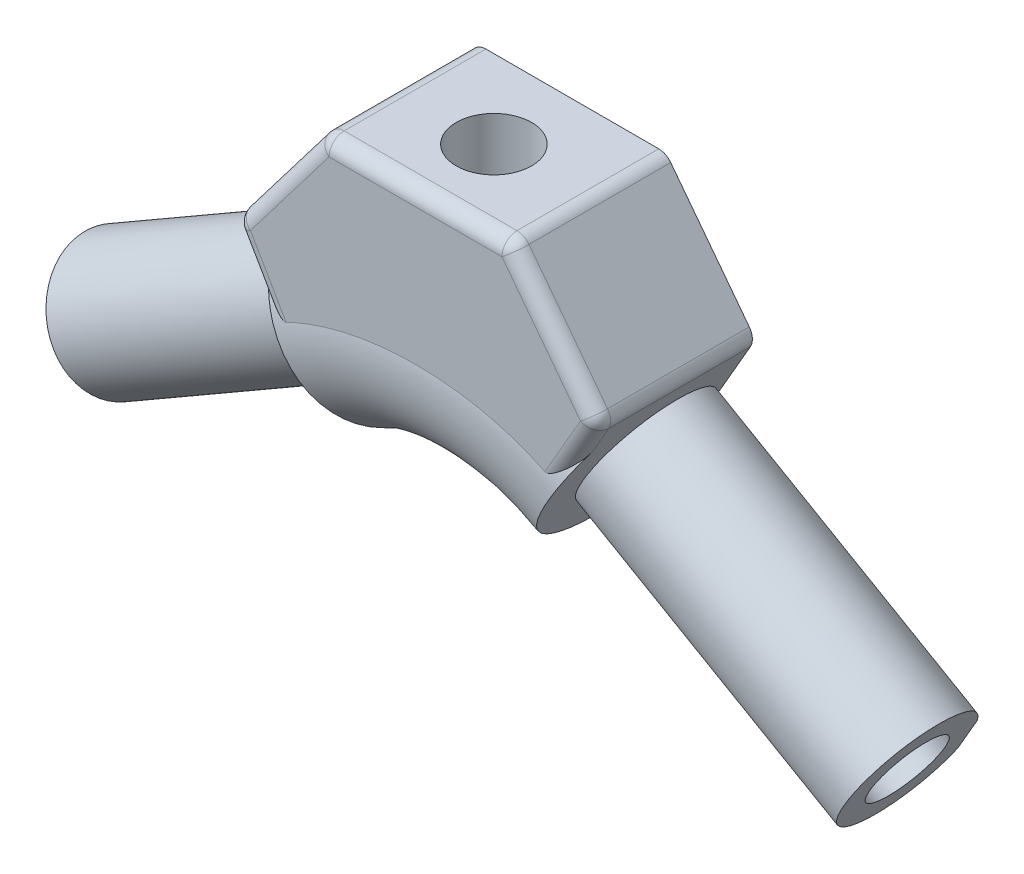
ISO-10303-21;
HEADER;
FILE_DESCRIPTION(('STEP AP214'),'2;1');
FILE_NAME('part.step','',(''),(''),'','','');
FILE_SCHEMA(('AUTOMOTIVE_DESIGN { 1 0 10303 214 1 1 1 1 }'));
ENDSEC;
DATA;
#1=APPLICATION_CONTEXT('core data for automotive mechanical design processes');
#2=APPLICATION_PROTOCOL_DEFINITION('international standard','automotive_design',2000,#1);
#3=PRODUCT_CONTEXT('',#1,'mechanical');
#4=PRODUCT('Part','Part','',(#3));
#5=PRODUCT_RELATED_PRODUCT_CATEGORY('part','',(#4));
#6=PRODUCT_DEFINITION_FORMATION('','',#4);
#7=PRODUCT_DEFINITION_CONTEXT('part definition',#1,'design');
#8=PRODUCT_DEFINITION('design','',#6,#7);
#9=PRODUCT_DEFINITION_SHAPE('','',#8);
#10=(LENGTH_UNIT() NAMED_UNIT(*) SI_UNIT(.MILLI.,.METRE.));
#11=(NAMED_UNIT(*) PLANE_ANGLE_UNIT() SI_UNIT($,.RADIAN.));
#12=(NAMED_UNIT(*) SI_UNIT($,.STERADIAN.) SOLID_ANGLE_UNIT());
#13=UNCERTAINTY_MEASURE_WITH_UNIT(LENGTH_MEASURE(1.E-05),#10,'distance_accuracy_value','');
#14=(GEOMETRIC_REPRESENTATION_CONTEXT(3) GLOBAL_UNCERTAINTY_ASSIGNED_CONTEXT((#13)) GLOBAL_UNIT_ASSIGNED_CONTEXT((#10,
#11,#12)) REPRESENTATION_CONTEXT('',''));
#15=CARTESIAN_POINT('',(0.,0.,0.));
#16=DIRECTION('',(0.,0.,1.));
#17=DIRECTION('',(1.,0.,0.));
#18=AXIS2_PLACEMENT_3D('',#15,#16,#17);
#19=CARTESIAN_POINT('',(12.8312689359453,32.113228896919,70.3420626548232));
#20=CARTESIAN_POINT('',(12.8662978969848,32.1334528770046,70.3420626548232));
#21=CARTESIAN_POINT('',(12.9013268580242,32.1536768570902,70.3420626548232));
#22=CARTESIAN_POINT('',(12.9363558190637,32.1739008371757,70.3420626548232));
#23=CARTESIAN_POINT('',(16.4392519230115,34.1962988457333,70.3420626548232));
#24=CARTESIAN_POINT('',(21.566600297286,34.2064351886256,70.1683668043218));
#25=CARTESIAN_POINT('',(25.0694964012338,32.184037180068,70.1683668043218));
#26=CARTESIAN_POINT('',(25.1045253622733,32.1638131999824,70.1683668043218));
#27=CARTESIAN_POINT('',(25.1395543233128,32.1435892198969,70.1683668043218));
#28=CARTESIAN_POINT('',(25.1745832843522,32.1233652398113,70.1683668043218));
#29=CARTESIAN_POINT('',(12.8355329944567,32.105963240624,70.4313523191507));
#30=CARTESIAN_POINT('',(12.8705446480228,32.1261772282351,70.4313523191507));
#31=CARTESIAN_POINT('',(12.9055563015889,32.1463912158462,70.4313523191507));
#32=CARTESIAN_POINT('',(12.9405679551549,32.1666052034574,70.4313523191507));
#33=CARTESIAN_POINT('',(16.441733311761,34.1880039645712,70.4313523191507));
#34=CARTESIAN_POINT('',(21.5665155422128,34.202291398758,70.2579794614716));
#35=CARTESIAN_POINT('',(25.0676808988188,32.180892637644,70.2579794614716));
#36=CARTESIAN_POINT('',(25.1026925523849,32.1606786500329,70.2579794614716));
#37=CARTESIAN_POINT('',(25.137704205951,32.1404646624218,70.2579794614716));
#38=CARTESIAN_POINT('',(25.172715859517,32.1202506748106,70.2579794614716));
#39=CARTESIAN_POINT('',(12.8476694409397,32.0853275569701,70.6075679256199));
#40=CARTESIAN_POINT('',(12.8826254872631,32.1055094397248,70.6075679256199));
#41=CARTESIAN_POINT('',(12.9175815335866,32.1256913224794,70.6075679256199));
#42=CARTESIAN_POINT('',(12.95253757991,32.145873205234,70.6075679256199));
#43=CARTESIAN_POINT('',(16.4481422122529,34.1640614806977,70.6075679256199));
#44=CARTESIAN_POINT('',(21.564841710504,34.1865502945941,70.4352241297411));
#45=CARTESIAN_POINT('',(25.0604463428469,32.1683620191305,70.4352241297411));
#46=CARTESIAN_POINT('',(25.0954023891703,32.1481801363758,70.4352241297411));
#47=CARTESIAN_POINT('',(25.1303584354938,32.1279982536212,70.4352241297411));
#48=CARTESIAN_POINT('',(25.1653144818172,32.1078163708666,70.4352241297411));
#49=CARTESIAN_POINT('',(12.87622979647,32.0368456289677,70.8640435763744));
#50=CARTESIAN_POINT('',(12.9110435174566,32.0569453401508,70.8640435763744));
#51=CARTESIAN_POINT('',(12.9458572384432,32.0770450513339,70.8640435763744));
#52=CARTESIAN_POINT('',(12.9806709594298,32.0971447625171,70.8640435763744));
#53=CARTESIAN_POINT('',(16.462043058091,34.1071158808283,70.8640435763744));
#54=CARTESIAN_POINT('',(21.557847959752,34.1415681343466,70.6943447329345));
#55=CARTESIAN_POINT('',(25.0392200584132,32.1315970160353,70.6943447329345));
#56=CARTESIAN_POINT('',(25.0740337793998,32.1114973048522,70.6943447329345));
#57=CARTESIAN_POINT('',(25.1088475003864,32.0913975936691,70.6943447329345));
#58=CARTESIAN_POINT('',(25.143661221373,32.071297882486,70.6943447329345));
#59=CARTESIAN_POINT('',(12.9146841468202,31.9716244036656,71.1119148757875));
#60=CARTESIAN_POINT('',(12.9492981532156,31.9916088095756,71.1119148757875));
#61=CARTESIAN_POINT('',(12.9839121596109,32.0115932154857,71.1119148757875));
#62=CARTESIAN_POINT('',(13.0185261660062,32.0315776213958,71.1119148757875));
#63=CARTESIAN_POINT('',(16.4799268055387,34.030018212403,71.1119148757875));
#64=CARTESIAN_POINT('',(21.5466548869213,34.0760590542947,70.9459144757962));
#65=CARTESIAN_POINT('',(25.0080555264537,32.0776184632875,70.9459144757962));
#66=CARTESIAN_POINT('',(25.0426695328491,32.0576340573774,70.9459144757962));
#67=CARTESIAN_POINT('',(25.0772835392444,32.0376496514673,70.9459144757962));
#68=CARTESIAN_POINT('',(25.1118975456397,32.0176652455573,70.9459144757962));
#69=CARTESIAN_POINT('',(13.2019359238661,31.484556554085,72.5429770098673));
#70=CARTESIAN_POINT('',(13.2350391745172,31.5036687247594,72.5429770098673));
#71=CARTESIAN_POINT('',(13.2681424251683,31.5227808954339,72.5429770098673));
#72=CARTESIAN_POINT('',(13.3012456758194,31.5418930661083,72.5429770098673));
#73=CARTESIAN_POINT('',(16.6115707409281,33.453110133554,72.5429770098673));
#74=CARTESIAN_POINT('',(21.4537310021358,33.5662160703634,72.4052010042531));
#75=CARTESIAN_POINT('',(24.7640560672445,31.6549990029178,72.4052010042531));
#76=CARTESIAN_POINT('',(24.7971593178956,31.6358868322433,72.4052010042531));
#77=CARTESIAN_POINT('',(24.8302625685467,31.6167746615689,72.4052010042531));
#78=CARTESIAN_POINT('',(24.8633658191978,31.5976624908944,72.4052010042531));
#79=CARTESIAN_POINT('',(13.9060410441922,30.294708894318,73.407207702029));
#80=CARTESIAN_POINT('',(13.9348577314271,30.3113462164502,73.407207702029));
#81=CARTESIAN_POINT('',(13.9636744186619,30.3279835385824,73.407207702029));
#82=CARTESIAN_POINT('',(13.9924911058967,30.3446208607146,73.407207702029));
#83=CARTESIAN_POINT('',(16.8741598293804,32.0083530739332,73.407207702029));
#84=CARTESIAN_POINT('',(21.2152720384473,32.1632536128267,73.3422198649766));
#85=CARTESIAN_POINT('',(24.0969407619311,30.4995213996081,73.3422198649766));
#86=CARTESIAN_POINT('',(24.1257574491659,30.4828840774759,73.3422198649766));
#87=CARTESIAN_POINT('',(24.1545741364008,30.4662467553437,73.3422198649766));
#88=CARTESIAN_POINT('',(24.1833908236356,30.4496094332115,73.3422198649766));
#89=CARTESIAN_POINT('',(15.5387392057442,27.5256459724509,73.1039339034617));
#90=CARTESIAN_POINT('',(15.5590611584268,27.5373788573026,73.1039339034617));
#91=CARTESIAN_POINT('',(15.5793831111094,27.5491117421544,73.1039339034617));
#92=CARTESIAN_POINT('',(15.599705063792,27.5608446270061,73.1039339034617));
#93=CARTESIAN_POINT('',(17.6319003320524,28.7341331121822,73.1039339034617));
#94=CARTESIAN_POINT('',(20.4517176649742,28.8789637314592,73.2115036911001));
#95=CARTESIAN_POINT('',(22.4839129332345,27.7056752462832,73.2115036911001));
#96=CARTESIAN_POINT('',(22.5042348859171,27.6939423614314,73.2115036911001));
#97=CARTESIAN_POINT('',(22.5245568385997,27.6822094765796,73.2115036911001));
#98=CARTESIAN_POINT('',(22.5448787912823,27.6704765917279,73.2115036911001));
#99=CARTESIAN_POINT('',(16.2082075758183,26.3959855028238,71.5173074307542));
#100=CARTESIAN_POINT('',(16.2242148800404,26.4052273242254,71.5173074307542));
#101=CARTESIAN_POINT('',(16.2402221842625,26.414469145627,71.5173074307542));
#102=CARTESIAN_POINT('',(16.2562294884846,26.4237109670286,71.5173074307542));
#103=CARTESIAN_POINT('',(17.8569599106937,27.3478931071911,71.5173074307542));
#104=CARTESIAN_POINT('',(20.1851205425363,27.420778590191,71.6974631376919));
#105=CARTESIAN_POINT('',(21.7858509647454,26.4965964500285,71.6974631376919));
#106=CARTESIAN_POINT('',(21.8018582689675,26.4873546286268,71.6974631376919));
#107=CARTESIAN_POINT('',(21.8178655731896,26.4781128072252,71.6974631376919));
#108=CARTESIAN_POINT('',(21.8338728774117,26.4688709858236,71.6974631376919));
#109=CARTESIAN_POINT('',(16.0378556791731,26.6867332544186,67.9457208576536));
#110=CARTESIAN_POINT('',(16.0544851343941,26.6963342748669,67.9457208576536));
#111=CARTESIAN_POINT('',(16.0711145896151,26.7059352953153,67.9457208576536));
#112=CARTESIAN_POINT('',(16.0877440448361,26.7155363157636,67.9457208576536));
#113=CARTESIAN_POINT('',(17.7506895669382,27.6756383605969,67.9457208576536));
#114=CARTESIAN_POINT('',(20.1955255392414,27.5824801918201,68.1129568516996));
#115=CARTESIAN_POINT('',(21.8584710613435,26.6223781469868,68.1129568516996));
#116=CARTESIAN_POINT('',(21.8751005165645,26.6127771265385,68.1129568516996));
#117=CARTESIAN_POINT('',(21.8917299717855,26.6031761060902,68.1129568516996));
#118=CARTESIAN_POINT('',(21.9083594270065,26.5935750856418,68.1129568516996));
#119=CARTESIAN_POINT('',(15.229732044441,28.0522412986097,66.6326720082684));
#120=CARTESIAN_POINT('',(15.2512982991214,28.0646925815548,66.6326720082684));
#121=CARTESIAN_POINT('',(15.2728645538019,28.0771438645,66.6326720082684));
#122=CARTESIAN_POINT('',(15.2944308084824,28.0895951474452,66.6326720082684));
#123=CARTESIAN_POINT('',(17.4510562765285,29.334723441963,66.6326720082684));
#124=CARTESIAN_POINT('',(20.4588658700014,29.1787040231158,66.7168329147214));
#125=CARTESIAN_POINT('',(22.6154913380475,27.9335757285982,66.7168329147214));
#126=CARTESIAN_POINT('',(22.637057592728,27.921124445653,66.7168329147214));
#127=CARTESIAN_POINT('',(22.6586238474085,27.9086731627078,66.7168329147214));
#128=CARTESIAN_POINT('',(22.6801901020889,27.8962218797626,66.7168329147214));
#129=CARTESIAN_POINT('',(13.5969442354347,30.821252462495,66.9359458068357));
#130=CARTESIAN_POINT('',(13.6270351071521,30.8386254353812,66.9359458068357));
#131=CARTESIAN_POINT('',(13.6571259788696,30.8559984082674,66.9359458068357));
#132=CARTESIAN_POINT('',(13.6872168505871,30.8733713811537,66.9359458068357));
#133=CARTESIAN_POINT('',(16.696304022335,32.6106686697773,66.9359458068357));
#134=CARTESIAN_POINT('',(21.2194319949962,32.4647191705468,66.8475490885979));
#135=CARTESIAN_POINT('',(24.2285191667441,30.7274218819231,66.8475490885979));
#136=CARTESIAN_POINT('',(24.2586100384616,30.7100489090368,66.8475490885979));
#137=CARTESIAN_POINT('',(24.288700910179,30.6926759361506,66.8475490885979));
#138=CARTESIAN_POINT('',(24.3187917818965,30.6753029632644,66.8475490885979));
#139=CARTESIAN_POINT('',(12.9870484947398,31.8506797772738,68.0434943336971));
#140=CARTESIAN_POINT('',(13.0210282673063,31.870298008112,68.0434943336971));
#141=CARTESIAN_POINT('',(13.0550080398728,31.8899162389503,68.0434943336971));
#142=CARTESIAN_POINT('',(13.0889878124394,31.9095344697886,68.0434943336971));
#143=CARTESIAN_POINT('',(16.4869650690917,33.8713575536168,68.0434943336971));
#144=CARTESIAN_POINT('',(21.4575655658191,33.7752817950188,67.8894420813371));
#145=CARTESIAN_POINT('',(24.8555428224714,31.8134587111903,67.8894420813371));
#146=CARTESIAN_POINT('',(24.8895225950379,31.793840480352,67.8894420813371));
#147=CARTESIAN_POINT('',(24.9235023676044,31.7742222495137,67.8894420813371));
#148=CARTESIAN_POINT('',(24.9574821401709,31.7546040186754,67.8894420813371));
#149=CARTESIAN_POINT('',(12.8403309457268,32.0983056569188,69.555058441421));
#150=CARTESIAN_POINT('',(12.8752483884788,32.118465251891,69.555058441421));
#151=CARTESIAN_POINT('',(12.9101658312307,32.1386248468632,69.555058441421));
#152=CARTESIAN_POINT('',(12.9450832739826,32.1587844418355,69.555058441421));
#153=CARTESIAN_POINT('',(16.4368275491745,34.1747439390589,69.555058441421));
#154=CARTESIAN_POINT('',(21.5479663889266,34.1484062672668,69.3834263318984));
#155=CARTESIAN_POINT('',(25.0397106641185,32.1324467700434,69.3834263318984));
#156=CARTESIAN_POINT('',(25.0746281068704,32.1122871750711,69.3834263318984));
#157=CARTESIAN_POINT('',(25.1095455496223,32.0921275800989,69.3834263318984));
#158=CARTESIAN_POINT('',(25.1444629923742,32.0719679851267,69.3834263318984));
#159=CARTESIAN_POINT('',(12.8260200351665,32.1223921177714,69.8127159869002));
#160=CARTESIAN_POINT('',(12.8610386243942,32.1426101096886,69.8127159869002));
#161=CARTESIAN_POINT('',(12.896057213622,32.1628281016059,69.8127159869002));
#162=CARTESIAN_POINT('',(12.9310758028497,32.1830460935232,69.8127159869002));
#163=CARTESIAN_POINT('',(16.4329347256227,34.2048452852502,69.8127159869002));
#164=CARTESIAN_POINT('',(21.5587374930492,34.1904211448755,69.639214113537));
#165=CARTESIAN_POINT('',(25.0605964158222,32.1686219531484,69.639214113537));
#166=CARTESIAN_POINT('',(25.0956150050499,32.1484039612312,69.639214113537));
#167=CARTESIAN_POINT('',(25.1306335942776,32.1281859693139,69.639214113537));
#168=CARTESIAN_POINT('',(25.1656521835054,32.1079679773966,69.639214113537));
#169=CARTESIAN_POINT('',(12.8222435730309,32.1286469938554,70.0751894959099));
#170=CARTESIAN_POINT('',(12.8573034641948,32.1488888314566,70.0751894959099));
#171=CARTESIAN_POINT('',(12.8923633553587,32.1691306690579,70.0751894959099));
#172=CARTESIAN_POINT('',(12.9274232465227,32.1893725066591,70.0751894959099));
#173=CARTESIAN_POINT('',(16.433412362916,34.2135562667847,70.0751894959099));
#174=CARTESIAN_POINT('',(21.5652819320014,34.2112947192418,69.9009198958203));
#175=CARTESIAN_POINT('',(25.0712710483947,32.1871109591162,69.9009198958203));
#176=CARTESIAN_POINT('',(25.1063309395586,32.166869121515,69.9009198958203));
#177=CARTESIAN_POINT('',(25.1413908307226,32.1466272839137,69.9009198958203));
#178=CARTESIAN_POINT('',(25.1764507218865,32.1263854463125,69.9009198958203));
#179=CARTESIAN_POINT('',(12.8270048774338,32.1204945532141,70.2527729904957));
#180=CARTESIAN_POINT('',(12.8620511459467,32.1407285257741,70.2527729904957));
#181=CARTESIAN_POINT('',(12.8970974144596,32.1609624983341,70.2527729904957));
#182=CARTESIAN_POINT('',(12.9321436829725,32.1811964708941,70.2527729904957));
#183=CARTESIAN_POINT('',(16.436770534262,34.2045937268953,70.2527729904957));
#184=CARTESIAN_POINT('',(21.5666850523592,34.2105789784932,70.078754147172));
#185=CARTESIAN_POINT('',(25.0713119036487,32.187181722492,70.078754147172));
#186=CARTESIAN_POINT('',(25.1063581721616,32.166947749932,70.078754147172));
#187=CARTESIAN_POINT('',(25.1414044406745,32.146713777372,70.078754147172));
#188=CARTESIAN_POINT('',(25.1764507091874,32.1264798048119,70.078754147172));
#189=CARTESIAN_POINT('',(12.8312689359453,32.113228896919,70.3420626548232));
#190=CARTESIAN_POINT('',(12.8662978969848,32.1334528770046,70.3420626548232));
#191=CARTESIAN_POINT('',(12.9013268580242,32.1536768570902,70.3420626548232));
#192=CARTESIAN_POINT('',(12.9363558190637,32.1739008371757,70.3420626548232));
#193=CARTESIAN_POINT('',(16.4392519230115,34.1962988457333,70.3420626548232));
#194=CARTESIAN_POINT('',(21.566600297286,34.2064351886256,70.1683668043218));
#195=CARTESIAN_POINT('',(25.0694964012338,32.184037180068,70.1683668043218));
#196=CARTESIAN_POINT('',(25.1045253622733,32.1638131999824,70.1683668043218));
#197=CARTESIAN_POINT('',(25.1395543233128,32.1435892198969,70.1683668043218));
#198=CARTESIAN_POINT('',(25.1745832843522,32.1233652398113,70.1683668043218));
#199=B_SPLINE_SURFACE_WITH_KNOTS('',3,3,((#19,#20,#21,#22,#23,#24,#25,#26,#27,#28),(#29,#30,#31,
#32,#33,#34,#35,#36,#37,#38),(#39,#40,#41,#42,#43,#44,#45,#46,#47,#48),(#49,#50,#51,#52,#53,#54,
#55,#56,#57,#58),(#59,#60,#61,#62,#63,#64,#65,#66,#67,#68),(#69,#70,#71,#72,#73,#74,#75,#76,#77,
#78),(#79,#80,#81,#82,#83,#84,#85,#86,#87,#88),(#89,#90,#91,#92,#93,#94,#95,#96,#97,#98),(#99,
#100,#101,#102,#103,#104,#105,#106,#107,#108),(#109,#110,#111,#112,#113,#114,#115,#116,#117,
#118),(#119,#120,#121,#122,#123,#124,#125,#126,#127,#128),(#129,#130,#131,#132,#133,#134,#135,
#136,#137,#138),(#139,#140,#141,#142,#143,#144,#145,#146,#147,#148),(#149,#150,#151,#152,#153,
#154,#155,#156,#157,#158),(#159,#160,#161,#162,#163,#164,#165,#166,#167,#168),(#169,#170,#171,
#172,#173,#174,#175,#176,#177,#178),(#179,#180,#181,#182,#183,#184,#185,#186,#187,#188),(#189,
#190,#191,#192,#193,#194,#195,#196,#197,#198)),.UNSPECIFIED.,.T.,.F.,.F.,(4,1,1,1,1,2,2,2,1,1,1,
1,4),(4,3,3,4),(0.,0.0125,0.0249999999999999,0.0375000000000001,0.05,0.25,0.5,0.75,0.95,0.9625,
0.975,0.9875,1.),(-0.01,0.,1.,1.01),.UNSPECIFIED.);
#200=CARTESIAN_POINT('',(19.,27.8441270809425,71.8867883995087));
#201=CARTESIAN_POINT('',(18.9400798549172,27.8440897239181,71.8867868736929));
#202=CARTESIAN_POINT('',(18.8801525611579,27.8402523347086,71.882447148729));
#203=CARTESIAN_POINT('',(18.7623843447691,27.8254992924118,71.8654417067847));
#204=CARTESIAN_POINT('',(18.7045454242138,27.8145770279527,71.8527682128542));
#205=CARTESIAN_POINT('',(18.5929763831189,27.7870713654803,71.8200844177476));
#206=CARTESIAN_POINT('',(18.5392179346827,27.770532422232,71.8001316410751));
#207=CARTESIAN_POINT('',(18.4361161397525,27.7332901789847,71.7538091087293));
#208=CARTESIAN_POINT('',(18.3867757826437,27.7125840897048,71.7274350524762));
#209=CARTESIAN_POINT('',(18.275253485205,27.6601451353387,71.6580761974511));
#210=CARTESIAN_POINT('',(18.2152079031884,27.6271915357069,71.6125729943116));
#211=CARTESIAN_POINT('',(18.1046785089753,27.5593013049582,71.5122785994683));
#212=CARTESIAN_POINT('',(18.0542109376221,27.5243614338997,71.4574719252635));
#213=CARTESIAN_POINT('',(17.9631299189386,27.4549781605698,71.3389519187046));
#214=CARTESIAN_POINT('',(17.9226077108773,27.420541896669,71.2751639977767));
#215=CARTESIAN_POINT('',(17.8532214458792,27.3552446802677,71.1399311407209));
#216=CARTESIAN_POINT('',(17.8243370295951,27.3243775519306,71.0684998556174));
#217=CARTESIAN_POINT('',(17.7845066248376,27.2746871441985,70.9348957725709));
#218=CARTESIAN_POINT('',(17.7710754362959,27.254694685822,70.8739003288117));
#219=CARTESIAN_POINT('',(17.7534727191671,27.2198583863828,70.7491592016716));
#220=CARTESIAN_POINT('',(17.7492933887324,27.2050102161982,70.6854158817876));
#221=CARTESIAN_POINT('',(17.7509053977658,27.1812620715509,70.5566340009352));
#222=CARTESIAN_POINT('',(17.756740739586,27.1723885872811,70.4915909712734));
#223=CARTESIAN_POINT('',(17.7786722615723,27.1608756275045,70.3626876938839));
#224=CARTESIAN_POINT('',(17.7947686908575,27.1582363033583,70.2988274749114));
#225=CARTESIAN_POINT('',(17.835281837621,27.158530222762,70.178909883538));
#226=CARTESIAN_POINT('',(17.8590251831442,27.1610803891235,70.1226206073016));
#227=CARTESIAN_POINT('',(17.9143412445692,27.1699899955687,70.014249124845));
#228=CARTESIAN_POINT('',(17.9459289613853,27.1763567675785,69.9621752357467));
#229=CARTESIAN_POINT('',(18.0182992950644,27.1921278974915,69.8603164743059));
#230=CARTESIAN_POINT('',(18.059533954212,27.2016975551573,69.8108793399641));
#231=CARTESIAN_POINT('',(18.1488533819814,27.2221404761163,69.7191023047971));
#232=CARTESIAN_POINT('',(18.1969301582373,27.2330122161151,69.6767542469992));
#233=CARTESIAN_POINT('',(18.304028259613,27.2556357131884,69.596094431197));
#234=CARTESIAN_POINT('',(18.3636603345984,27.2673693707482,69.5585842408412));
#235=CARTESIAN_POINT('',(18.4886757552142,27.2887788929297,69.4939865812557));
#236=CARTESIAN_POINT('',(18.5540586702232,27.2984549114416,69.4668983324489));
#237=CARTESIAN_POINT('',(18.6886659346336,27.3141894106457,69.4241306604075));
#238=CARTESIAN_POINT('',(18.7578774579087,27.3202592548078,69.4084153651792));
#239=CARTESIAN_POINT('',(18.8981936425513,27.3278192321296,69.3889318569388));
#240=CARTESIAN_POINT('',(18.9692973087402,27.3293117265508,69.385157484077));
#241=CARTESIAN_POINT('',(19.1064061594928,27.3275350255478,69.3895616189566));
#242=CARTESIAN_POINT('',(19.1724414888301,27.3245699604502,69.3969768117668));
#243=CARTESIAN_POINT('',(19.3022396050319,27.3148716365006,69.4220780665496));
#244=CARTESIAN_POINT('',(19.3660021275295,27.3081379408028,69.4397653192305));
#245=CARTESIAN_POINT('',(19.4899051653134,27.2918257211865,69.4848919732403));
#246=CARTESIAN_POINT('',(19.5500271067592,27.2822338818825,69.5123771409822));
#247=CARTESIAN_POINT('',(19.6650403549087,27.2615363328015,69.5763401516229));
#248=CARTESIAN_POINT('',(19.7199296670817,27.2504300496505,69.6128214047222));
#249=CARTESIAN_POINT('',(19.7991843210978,27.2334256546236,69.6750000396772));
#250=CARTESIAN_POINT('',(19.8258605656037,27.2275107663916,69.6978076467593));
#251=CARTESIAN_POINT('',(19.8772077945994,27.2159444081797,69.7455893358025));
#252=CARTESIAN_POINT('',(19.9018806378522,27.2102926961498,69.7705613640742));
#253=CARTESIAN_POINT('',(19.9727092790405,27.1940942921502,69.8485855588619));
#254=CARTESIAN_POINT('',(20.0156917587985,27.1843005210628,69.9047588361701));
#255=CARTESIAN_POINT('',(20.0916902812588,27.1688053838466,70.023849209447));
#256=CARTESIAN_POINT('',(20.1247249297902,27.1630963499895,70.086753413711));
#257=CARTESIAN_POINT('',(20.1796939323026,27.1576039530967,70.2174659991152));
#258=CARTESIAN_POINT('',(20.2016409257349,27.157813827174,70.2852686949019));
#259=CARTESIAN_POINT('',(20.2320377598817,27.164945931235,70.4162434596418));
#260=CARTESIAN_POINT('',(20.2416281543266,27.1711871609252,70.4791903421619));
#261=CARTESIAN_POINT('',(20.2511844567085,27.1895305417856,70.6049523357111));
#262=CARTESIAN_POINT('',(20.2511502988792,27.2016327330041,70.6677674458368));
#263=CARTESIAN_POINT('',(20.2421214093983,27.230586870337,70.7891151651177));
#264=CARTESIAN_POINT('',(20.2334585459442,27.2472463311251,70.8477202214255));
#265=CARTESIAN_POINT('',(20.2083969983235,27.2845633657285,70.9618990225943));
#266=CARTESIAN_POINT('',(20.1919962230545,27.3052220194,71.0174719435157));
#267=CARTESIAN_POINT('',(20.1498646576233,27.3520786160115,71.1311670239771));
#268=CARTESIAN_POINT('',(20.1232592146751,27.378642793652,71.1888121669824));
#269=CARTESIAN_POINT('',(20.0622195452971,27.4338730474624,71.2987179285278));
#270=CARTESIAN_POINT('',(20.0277770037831,27.4625413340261,71.3509727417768));
#271=CARTESIAN_POINT('',(19.9448984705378,27.525582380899,71.4584012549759));
#272=CARTESIAN_POINT('',(19.8950639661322,27.5600648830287,71.5124482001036));
#273=CARTESIAN_POINT('',(19.8133535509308,27.6102980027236,71.5866878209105));
#274=CARTESIAN_POINT('',(19.784958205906,27.6267933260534,71.6102951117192));
#275=CARTESIAN_POINT('',(19.7258377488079,27.6589543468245,71.6551390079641));
#276=CARTESIAN_POINT('',(19.6951096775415,27.6746189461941,71.6763725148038));
#277=CARTESIAN_POINT('',(19.6125268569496,27.7136138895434,71.7280684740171));
#278=CARTESIAN_POINT('',(19.5589398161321,27.7359884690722,71.7565470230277));
#279=CARTESIAN_POINT('',(19.4466800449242,27.7756801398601,71.8058567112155));
#280=CARTESIAN_POINT('',(19.388017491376,27.7930070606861,71.8267027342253));
#281=CARTESIAN_POINT('',(19.2748835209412,27.8188677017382,71.8573999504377));
#282=CARTESIAN_POINT('',(19.220916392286,27.828273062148,71.8683559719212));
#283=CARTESIAN_POINT('',(19.1113009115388,27.8409183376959,71.8830488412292));
#284=CARTESIAN_POINT('',(19.0556535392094,27.844161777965,71.8867898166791));
#285=CARTESIAN_POINT('',(19.,27.8441270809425,71.8867883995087));
#286=B_SPLINE_CURVE_WITH_KNOTS('',3,(#200,#201,#202,#203,#204,#205,#206,#207,#208,#209,#210,
#211,#212,#213,#214,#215,#216,#217,#218,#219,#220,#221,#222,#223,#224,#225,#226,#227,#228,#229,
#230,#231,#232,#233,#234,#235,#236,#237,#238,#239,#240,#241,#242,#243,#244,#245,#246,#247,#248,
#249,#250,#251,#252,#253,#254,#255,#256,#257,#258,#259,#260,#261,#262,#263,#264,#265,#266,#267,
#268,#269,#270,#271,#272,#273,#274,#275,#276,#277,#278,#279,#280,#281,#282,#283,#284,#285),
.UNSPECIFIED.,.T.,.F.,(4,2,2,2,2,2,2,2,2,2,2,2,2,2,2,2,2,2,2,2,2,2,2,2,2,2,2,2,2,2,2,2,2,2,2,2,
2,2,2,2,2,2,4),(0.,0.179517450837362,0.359202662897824,0.537497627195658,0.715912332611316,
0.961331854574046,1.20716387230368,1.4551732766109,1.70274690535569,1.89867165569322,
2.0944311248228,2.29105292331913,2.48767949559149,2.67031797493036,2.85330844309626,
3.04776201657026,3.24199028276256,3.45524188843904,3.66847753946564,3.88103764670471,
4.09348808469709,4.29208615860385,4.49070725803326,4.69026854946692,4.88990560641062,
4.9965725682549,5.1031394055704,5.31620966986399,5.52887890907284,5.74130516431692,
5.93224770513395,6.12319155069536,6.30706450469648,6.49098717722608,6.69668272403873,
6.90259753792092,7.14504251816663,7.26625560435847,7.38762511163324,7.58089003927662,
7.77377605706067,7.94060646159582,8.10734139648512),.UNSPECIFIED.);
#287=CARTESIAN_POINT('',(19.,27.8441270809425,71.8867883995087));
#288=VERTEX_POINT('',#287);
#289=EDGE_CURVE('E309',#288,#288,#286,.T.);
#290=CARTESIAN_POINT('',(23.4458287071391,29.3717622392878,70.0367883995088));
#291=DIRECTION('',(0.866025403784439,-0.5,0.));
#292=DIRECTION('',(0.5,0.866025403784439,0.));
#293=AXIS2_PLACEMENT_3D('',#290,#291,#292);
#294=CIRCLE('',#293,3.25000000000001);
#295=CARTESIAN_POINT('',(23.731416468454,29.8664147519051,73.2367883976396));
#296=VERTEX_POINT('',#295);
#297=CARTESIAN_POINT('',(22.1649291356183,27.1531791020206,68.0367883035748));
#298=VERTEX_POINT('',#297);
#299=EDGE_CURVE('E241',#296,#298,#294,.T.);
#300=CARTESIAN_POINT('',(25.0694964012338,32.184037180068,70.1683668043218));
#301=CARTESIAN_POINT('',(25.0713119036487,32.187181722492,70.078754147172));
#302=CARTESIAN_POINT('',(25.0712710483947,32.1871109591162,69.9009198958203));
#303=CARTESIAN_POINT('',(25.0605964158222,32.1686219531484,69.639214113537));
#304=CARTESIAN_POINT('',(25.0397106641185,32.1324467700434,69.3834263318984));
#305=CARTESIAN_POINT('',(24.8555428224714,31.8134587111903,67.8894420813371));
#306=CARTESIAN_POINT('',(24.2285191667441,30.7274218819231,66.8475490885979));
#307=CARTESIAN_POINT('',(22.6154913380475,27.9335757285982,66.7168329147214));
#308=CARTESIAN_POINT('',(21.8584710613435,26.6223781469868,68.1129568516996));
#309=CARTESIAN_POINT('',(21.7858509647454,26.4965964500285,71.6974631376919));
#310=CARTESIAN_POINT('',(22.4839129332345,27.7056752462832,73.2115036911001));
#311=CARTESIAN_POINT('',(24.0969407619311,30.4995213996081,73.3422198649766));
#312=CARTESIAN_POINT('',(24.7640560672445,31.6549990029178,72.4052010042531));
#313=CARTESIAN_POINT('',(25.0080555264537,32.0776184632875,70.9459144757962));
#314=CARTESIAN_POINT('',(25.0392200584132,32.1315970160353,70.6943447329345));
#315=CARTESIAN_POINT('',(25.0604463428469,32.1683620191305,70.4352241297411));
#316=CARTESIAN_POINT('',(25.0676808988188,32.180892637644,70.2579794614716));
#317=CARTESIAN_POINT('',(25.0694964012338,32.184037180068,70.1683668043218));
#318=B_SPLINE_CURVE_WITH_KNOTS('',3,(#300,#301,#302,#303,#304,#305,#306,#307,#308,#309,#310,
#311,#312,#313,#314,#315,#316,#317),.UNSPECIFIED.,.T.,.F.,(4,1,1,1,1,2,2,2,1,1,1,1,4),(0.,
0.0125,0.025,0.0375,0.05,0.25,0.5,0.75,0.95,0.9625,0.975,0.9875,1.),.UNSPECIFIED.);
#319=CARTESIAN_POINT('',(24.3508809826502,30.9393587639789,72.7367883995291));
#320=VERTEX_POINT('',#319);
#321=EDGE_CURVE('E340',#320,#296,#318,.F.);
#322=CARTESIAN_POINT('',(24.3506083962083,30.9388879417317,72.7359786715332));
#323=CARTESIAN_POINT('',(24.3389990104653,30.9187371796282,72.7516047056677));
#324=CARTESIAN_POINT('',(24.3266635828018,30.8987787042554,72.7669261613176));
#325=CARTESIAN_POINT('',(24.3007048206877,30.8592491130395,72.7969116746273));
#326=CARTESIAN_POINT('',(24.2870828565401,30.8396776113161,72.8115764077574));
#327=CARTESIAN_POINT('',(24.2586924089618,30.800885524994,72.8402309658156));
#328=CARTESIAN_POINT('',(24.2439241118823,30.7816648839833,72.8542208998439));
#329=CARTESIAN_POINT('',(24.2131422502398,30.7432816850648,72.8817056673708));
#330=CARTESIAN_POINT('',(24.197113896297,30.7241238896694,72.8951905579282));
#331=CARTESIAN_POINT('',(24.1641075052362,30.6861292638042,72.9214409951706));
#332=CARTESIAN_POINT('',(24.1471292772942,30.6672924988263,72.934206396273));
#333=CARTESIAN_POINT('',(24.1123224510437,30.6299363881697,72.9590065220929));
#334=CARTESIAN_POINT('',(24.0944940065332,30.6114169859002,72.9710413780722));
#335=CARTESIAN_POINT('',(24.0488008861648,30.5653458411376,73.000314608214));
#336=CARTESIAN_POINT('',(24.0204411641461,30.5379878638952,73.0170884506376));
#337=CARTESIAN_POINT('',(23.9621553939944,30.4839579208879,73.0489884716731));
#338=CARTESIAN_POINT('',(23.9322284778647,30.457286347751,73.0641137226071));
#339=CARTESIAN_POINT('',(23.8708999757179,30.4046472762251,73.0927472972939));
#340=CARTESIAN_POINT('',(23.8394956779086,30.3786812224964,73.1062524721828));
#341=CARTESIAN_POINT('',(23.7755928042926,30.3278808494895,73.131514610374));
#342=CARTESIAN_POINT('',(23.7431059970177,30.3030387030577,73.1432856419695));
#343=CARTESIAN_POINT('',(23.6767491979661,30.2545960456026,73.1652070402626));
#344=CARTESIAN_POINT('',(23.6428812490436,30.2309938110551,73.1753596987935));
#345=CARTESIAN_POINT('',(23.5907912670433,30.1971608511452,73.1893441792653));
#346=CARTESIAN_POINT('',(23.573235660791,30.1861575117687,73.1937935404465));
#347=CARTESIAN_POINT('',(23.53758401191,30.1648922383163,73.2022663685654));
#348=CARTESIAN_POINT('',(23.5194882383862,30.1546299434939,73.2062900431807));
#349=CARTESIAN_POINT('',(23.4887521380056,30.138497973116,73.2126089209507));
#350=CARTESIAN_POINT('',(23.4763082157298,30.1323059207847,73.2150325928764));
#351=CARTESIAN_POINT('',(23.4509832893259,30.1206480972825,73.2196601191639));
#352=CARTESIAN_POINT('',(23.4381009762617,30.1151847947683,73.2218632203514));
#353=CARTESIAN_POINT('',(23.4117028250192,30.1053656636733,73.2260167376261));
#354=CARTESIAN_POINT('',(23.3981813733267,30.1010234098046,73.2279639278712));
#355=CARTESIAN_POINT('',(23.3705752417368,30.0943862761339,73.2314641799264));
#356=CARTESIAN_POINT('',(23.3564942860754,30.0920796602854,73.2330194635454));
#357=CARTESIAN_POINT('',(23.3361730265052,30.0915121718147,73.2347721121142));
#358=CARTESIAN_POINT('',(23.3300147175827,30.0916987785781,73.2352393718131));
#359=CARTESIAN_POINT('',(23.3178021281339,30.0930161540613,73.2360068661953));
#360=CARTESIAN_POINT('',(23.3117474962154,30.0941425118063,73.236307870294));
#361=CARTESIAN_POINT('',(23.3004064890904,30.0973520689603,73.2366922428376));
#362=CARTESIAN_POINT('',(23.2950970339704,30.0993537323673,73.2367907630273));
#363=CARTESIAN_POINT('',(23.2900096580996,30.1018757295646,73.2367883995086));
#364=B_SPLINE_CURVE_WITH_KNOTS('',3,(#322,#323,#324,#325,#326,#327,#328,#329,#330,#331,#332,
#333,#334,#335,#336,#337,#338,#339,#340,#341,#342,#343,#344,#345,#346,#347,#348,#349,#350,#351,
#352,#353,#354,#355,#356,#357,#358,#359,#360,#361,#362,#363),.UNSPECIFIED.,.F.,.F.,(4,2,2,2,2,2,
2,2,2,2,2,2,2,2,2,2,2,2,2,2,4),(0.,0.0840314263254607,0.167974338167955,0.251903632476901,
0.337033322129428,0.422180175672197,0.507311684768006,0.635716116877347,0.764192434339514,
0.892914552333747,1.02052689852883,1.14795689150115,1.21151561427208,1.27504318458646,
1.3173541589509,1.35980500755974,1.40274804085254,1.44544184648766,1.46392420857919,
1.48232030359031,1.49928069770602),.UNSPECIFIED.);
#365=CARTESIAN_POINT('',(23.2900096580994,30.1018757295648,73.2367883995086));
#366=VERTEX_POINT('',#365);
#367=EDGE_CURVE('E12',#320,#366,#364,.T.);
#368=CARTESIAN_POINT('',(23.7313648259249,29.8663253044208,73.2367883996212));
#369=CARTESIAN_POINT('',(23.5334692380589,29.9805629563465,73.2367883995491));
#370=CARTESIAN_POINT('',(23.3303970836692,30.0855168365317,73.2367883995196));
#371=CARTESIAN_POINT('',(22.916205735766,30.2775872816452,73.236788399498));
#372=CARTESIAN_POINT('',(22.7050947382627,30.3647214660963,73.2367883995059));
#373=CARTESIAN_POINT('',(22.2779204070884,30.5216691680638,73.2367883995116));
#374=CARTESIAN_POINT('',(22.0618911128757,30.5915762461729,73.2367883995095));
#375=CARTESIAN_POINT('',(21.6253390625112,30.7155246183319,73.236788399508));
#376=CARTESIAN_POINT('',(21.4048160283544,30.769564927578,73.2367883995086));
#377=CARTESIAN_POINT('',(20.949972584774,30.8647148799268,73.236788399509));
#378=CARTESIAN_POINT('',(20.7154972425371,30.9050811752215,73.2367883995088));
#379=CARTESIAN_POINT('',(20.2443066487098,30.9698147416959,73.2367883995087));
#380=CARTESIAN_POINT('',(20.0075907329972,30.9941771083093,73.2367883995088));
#381=CARTESIAN_POINT('',(19.4511910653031,31.0330300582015,73.2367883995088));
#382=CARTESIAN_POINT('',(19.1310496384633,31.0412180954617,73.2367883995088));
#383=CARTESIAN_POINT('',(18.4910829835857,31.0297430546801,73.2367883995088));
#384=CARTESIAN_POINT('',(18.1712581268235,31.01006073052,73.2367883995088));
#385=CARTESIAN_POINT('',(17.4870575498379,30.9373046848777,73.2367883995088));
#386=CARTESIAN_POINT('',(17.1231500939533,30.879689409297,73.2367883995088));
#387=CARTESIAN_POINT('',(16.404081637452,30.7250906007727,73.2367883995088));
#388=CARTESIAN_POINT('',(16.0489105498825,30.6281549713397,73.2367883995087));
#389=CARTESIAN_POINT('',(15.4529806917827,30.4255281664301,73.2367883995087));
#390=CARTESIAN_POINT('',(15.2086592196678,30.3303476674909,73.2367883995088));
#391=CARTESIAN_POINT('',(14.8498077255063,30.1700589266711,73.2367883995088));
#392=CARTESIAN_POINT('',(14.7313630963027,30.1136532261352,73.2367883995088));
#393=CARTESIAN_POINT('',(14.4974986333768,29.9947719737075,73.2367883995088));
#394=CARTESIAN_POINT('',(14.3820801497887,29.9322937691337,73.2367883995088));
#395=CARTESIAN_POINT('',(14.2684284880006,29.8666833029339,73.2367883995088));
#396=B_SPLINE_CURVE_WITH_KNOTS('',3,(#368,#369,#370,#371,#372,#373,#374,#375,#376,#377,#378,
#379,#380,#381,#382,#383,#384,#385,#386,#387,#388,#389,#390,#391,#392,#393,#394,#395),
.UNSPECIFIED.,.F.,.F.,(4,2,2,2,2,2,2,2,2,2,2,2,2,4),(0.,0.68502869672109,1.36937674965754,
2.04992186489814,2.73050921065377,3.44369587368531,4.15710099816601,5.11655200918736,
6.07666590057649,7.17994849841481,8.28189099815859,9.06734773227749,9.46075802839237,
9.85434095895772),.UNSPECIFIED.);
#397=CARTESIAN_POINT('',(14.7099561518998,30.1019349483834,73.2367883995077));
#398=VERTEX_POINT('',#397);
#399=EDGE_CURVE('E227',#366,#398,#396,.T.);
#400=CARTESIAN_POINT('',(14.7099561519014,30.1019349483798,73.2367883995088));
#401=CARTESIAN_POINT('',(14.6989780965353,30.0965399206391,73.2367878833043));
#402=CARTESIAN_POINT('',(14.687333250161,30.0935941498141,73.2363420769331));
#403=CARTESIAN_POINT('',(14.6670664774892,30.091509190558,73.2350514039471));
#404=CARTESIAN_POINT('',(14.658537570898,30.0915193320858,73.2343580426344));
#405=CARTESIAN_POINT('',(14.6415555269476,30.0927790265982,73.2327507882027));
#406=CARTESIAN_POINT('',(14.6331038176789,30.0940400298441,73.231834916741));
#407=CARTESIAN_POINT('',(14.6129117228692,30.0981148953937,73.2294304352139));
#408=CARTESIAN_POINT('',(14.6012697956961,30.1013570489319,73.2278622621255));
#409=CARTESIAN_POINT('',(14.5783570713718,30.1088903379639,73.2244964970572));
#410=CARTESIAN_POINT('',(14.5670872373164,30.1131839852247,73.2226983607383));
#411=CARTESIAN_POINT('',(14.5448289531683,30.1224847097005,73.2189087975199));
#412=CARTESIAN_POINT('',(14.5338418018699,30.1274945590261,73.2169166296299));
#413=CARTESIAN_POINT('',(14.5121539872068,30.13800140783,73.2127701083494));
#414=CARTESIAN_POINT('',(14.5014530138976,30.1434978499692,73.2106159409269));
#415=CARTESIAN_POINT('',(14.470176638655,30.1602637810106,73.2040292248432));
#416=CARTESIAN_POINT('',(14.449918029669,30.1720393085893,73.1993832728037));
#417=CARTESIAN_POINT('',(14.4100461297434,30.1964358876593,73.189557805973));
#418=CARTESIAN_POINT('',(14.3904332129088,30.2090574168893,73.1843779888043));
#419=CARTESIAN_POINT('',(14.3323174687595,30.2478316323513,73.1680459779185));
#420=CARTESIAN_POINT('',(14.294609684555,30.2748524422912,73.1561167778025));
#421=CARTESIAN_POINT('',(14.2209264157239,30.3302570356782,73.130224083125));
#422=CARTESIAN_POINT('',(14.1849517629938,30.3586414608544,73.1162596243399));
#423=CARTESIAN_POINT('',(14.1147609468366,30.4164125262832,73.0863025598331));
#424=CARTESIAN_POINT('',(14.0805428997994,30.4457980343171,73.0703121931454));
#425=CARTESIAN_POINT('',(14.0140505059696,30.5053807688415,73.0363213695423));
#426=CARTESIAN_POINT('',(13.9817710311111,30.5355755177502,73.0183266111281));
#427=CARTESIAN_POINT('',(13.9192883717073,30.5968433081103,72.9802688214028));
#428=CARTESIAN_POINT('',(13.8890862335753,30.627916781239,72.9602047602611));
#429=CARTESIAN_POINT('',(13.8312638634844,30.6908198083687,72.9181145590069));
#430=CARTESIAN_POINT('',(13.8036330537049,30.7226455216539,72.8960972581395));
#431=CARTESIAN_POINT('',(13.751291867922,30.7872220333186,72.8500789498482));
#432=CARTESIAN_POINT('',(13.7265792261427,30.8199720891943,72.8260795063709));
#433=CARTESIAN_POINT('',(13.6842349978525,30.881385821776,72.7800385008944));
#434=CARTESIAN_POINT('',(13.6660989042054,30.9099033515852,72.7582634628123));
#435=CARTESIAN_POINT('',(13.6494346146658,30.9388138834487,72.7358529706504));
#436=B_SPLINE_CURVE_WITH_KNOTS('',3,(#400,#401,#402,#403,#404,#405,#406,#407,#408,#409,#410,
#411,#412,#413,#414,#415,#416,#417,#418,#419,#420,#421,#422,#423,#424,#425,#426,#427,#428,#429,
#430,#431,#432,#433,#434,#435),.UNSPECIFIED.,.F.,.F.,(4,2,2,2,2,2,2,2,2,2,2,2,2,2,2,2,2,4),(0.,
0.0357780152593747,0.0612738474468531,0.0870052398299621,0.123467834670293,0.160018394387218,
0.196714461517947,0.233369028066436,0.304984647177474,0.376641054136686,0.520206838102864,
0.6638408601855,0.807317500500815,0.950396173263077,1.09354639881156,1.23607897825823,
1.3785001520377,1.49901819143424),.UNSPECIFIED.);
#437=CARTESIAN_POINT('',(13.6491198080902,30.9393573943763,72.736788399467));
#438=VERTEX_POINT('',#437);
#439=EDGE_CURVE('E90',#398,#438,#436,.T.);
#440=CARTESIAN_POINT('',(12.9363558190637,32.1739008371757,70.3420626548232));
#441=CARTESIAN_POINT('',(12.9405679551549,32.1666052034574,70.4313523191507));
#442=CARTESIAN_POINT('',(12.95253757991,32.145873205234,70.6075679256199));
#443=CARTESIAN_POINT('',(12.9806709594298,32.0971447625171,70.8640435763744));
#444=CARTESIAN_POINT('',(13.0185261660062,32.0315776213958,71.1119148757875));
#445=CARTESIAN_POINT('',(13.3012456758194,31.5418930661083,72.5429770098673));
#446=CARTESIAN_POINT('',(13.9924911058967,30.3446208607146,73.407207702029));
#447=CARTESIAN_POINT('',(15.599705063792,27.5608446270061,73.1039339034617));
#448=CARTESIAN_POINT('',(16.2562294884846,26.4237109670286,71.5173074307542));
#449=CARTESIAN_POINT('',(16.0877440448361,26.7155363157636,67.9457208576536));
#450=CARTESIAN_POINT('',(15.2944308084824,28.0895951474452,66.6326720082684));
#451=CARTESIAN_POINT('',(13.6872168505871,30.8733713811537,66.9359458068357));
#452=CARTESIAN_POINT('',(13.0889878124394,31.9095344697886,68.0434943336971));
#453=CARTESIAN_POINT('',(12.9450832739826,32.1587844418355,69.555058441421));
#454=CARTESIAN_POINT('',(12.9310758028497,32.1830460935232,69.8127159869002));
#455=CARTESIAN_POINT('',(12.9274232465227,32.1893725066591,70.0751894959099));
#456=CARTESIAN_POINT('',(12.9321436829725,32.1811964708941,70.2527729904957));
#457=CARTESIAN_POINT('',(12.9363558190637,32.1739008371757,70.3420626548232));
#458=B_SPLINE_CURVE_WITH_KNOTS('',3,(#440,#441,#442,#443,#444,#445,#446,#447,#448,#449,#450,
#451,#452,#453,#454,#455,#456,#457),.UNSPECIFIED.,.T.,.F.,(4,1,1,1,1,2,2,2,1,1,1,1,4),(0.,
0.0125,0.0249999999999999,0.0375000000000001,0.05,0.25,0.5,0.75,0.95,0.9625,0.975,0.9875,1.),.UNSPECIFIED.);
#459=CARTESIAN_POINT('',(14.2684643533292,29.8666211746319,73.2367884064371));
#460=VERTEX_POINT('',#459);
#461=EDGE_CURVE('E98',#460,#438,#458,.F.);
#462=CARTESIAN_POINT('',(14.554171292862,29.3717622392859,70.0367883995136));
#463=DIRECTION('',(-0.866025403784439,-0.5,0.));
#464=DIRECTION('',(0.5,-0.866025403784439,0.));
#465=AXIS2_PLACEMENT_3D('',#462,#463,#464);
#466=CIRCLE('',#465,3.25000000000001);
#467=CARTESIAN_POINT('',(15.8351454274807,27.1530499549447,68.0367884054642));
#468=VERTEX_POINT('',#467);
#469=EDGE_CURVE('E238',#468,#460,#466,.T.);
#470=CARTESIAN_POINT('',(22.1651721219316,27.1535999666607,68.0367883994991));
#471=CARTESIAN_POINT('',(22.0470274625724,27.2217910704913,68.0367883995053));
#472=CARTESIAN_POINT('',(21.9261965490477,27.2851998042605,68.0367883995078));
#473=CARTESIAN_POINT('',(21.6802289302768,27.4027461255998,68.0367883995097));
#474=CARTESIAN_POINT('',(21.5550961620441,27.4568919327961,68.036788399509));
#475=CARTESIAN_POINT('',(21.3016243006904,27.556229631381,68.0367883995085));
#476=CARTESIAN_POINT('',(21.1732919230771,27.6014387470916,68.0367883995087));
#477=CARTESIAN_POINT('',(20.9139264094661,27.6833451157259,68.0367883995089));
#478=CARTESIAN_POINT('',(20.7828924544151,27.7200397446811,68.0367883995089));
#479=CARTESIAN_POINT('',(20.3365957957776,27.8301235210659,68.0367883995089));
#480=CARTESIAN_POINT('',(20.0164349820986,27.8843439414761,68.0367883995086));
#481=CARTESIAN_POINT('',(19.3716252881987,27.9482964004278,68.0367883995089));
#482=CARTESIAN_POINT('',(19.0469732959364,27.9579958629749,68.0367883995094));
#483=CARTESIAN_POINT('',(18.5311470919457,27.9381523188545,68.0367883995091));
#484=CARTESIAN_POINT('',(18.3393287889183,27.9229510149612,68.0367883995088));
#485=CARTESIAN_POINT('',(17.9578764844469,27.8766675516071,68.0367883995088));
#486=CARTESIAN_POINT('',(17.7682394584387,27.8456110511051,68.0367883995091));
#487=CARTESIAN_POINT('',(17.4282037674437,27.7746349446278,68.0367883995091));
#488=CARTESIAN_POINT('',(17.2772127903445,27.7375311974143,68.0367883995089));
#489=CARTESIAN_POINT('',(16.9783723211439,27.6522697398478,68.0367883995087));
#490=CARTESIAN_POINT('',(16.8305226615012,27.6041126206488,68.0367883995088));
#491=CARTESIAN_POINT('',(16.5380405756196,27.4959838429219,68.0367883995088));
#492=CARTESIAN_POINT('',(16.3934366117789,27.4359346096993,68.0367883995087));
#493=CARTESIAN_POINT('',(16.109711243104,27.3037902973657,68.0367883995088));
#494=CARTESIAN_POINT('',(15.9705944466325,27.2316853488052,68.036788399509));
#495=CARTESIAN_POINT('',(15.8349540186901,27.1533814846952,68.0367883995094));
#496=B_SPLINE_CURVE_WITH_KNOTS('',3,(#470,#471,#472,#473,#474,#475,#476,#477,#478,#479,#480,
#481,#482,#483,#484,#485,#486,#487,#488,#489,#490,#491,#492,#493,#494,#495),.UNSPECIFIED.,.F.,
.F.,(4,2,2,2,2,2,2,2,2,2,2,2,4),(0.,0.409030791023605,0.817696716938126,1.22556714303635,
1.63356309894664,2.60412511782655,3.57539718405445,4.1520825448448,4.72783758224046,
5.19390046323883,5.65993842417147,6.12912300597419,6.59869358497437),.UNSPECIFIED.);
#497=EDGE_CURVE('E397',#298,#468,#496,.T.);
#498=ORIENTED_EDGE('',*,*,#289,.F.);
#499=EDGE_LOOP('',(#498));
#500=FACE_BOUND('',#499,.T.);
#501=ORIENTED_EDGE('',*,*,#299,.F.);
#502=ORIENTED_EDGE('',*,*,#321,.F.);
#503=ORIENTED_EDGE('',*,*,#367,.T.);
#504=ORIENTED_EDGE('',*,*,#399,.T.);
#505=ORIENTED_EDGE('',*,*,#439,.T.);
#506=ORIENTED_EDGE('',*,*,#461,.F.);
#507=ORIENTED_EDGE('',*,*,#469,.F.);
#508=ORIENTED_EDGE('',*,*,#497,.F.);
#509=EDGE_LOOP('',(#501,#502,#503,#504,#505,#506,#507,#508));
#510=FACE_BOUND('',#509,.T.);
#511=ADVANCED_FACE('F80',(#500,#510),#199,.T.);
#512=CARTESIAN_POINT('',(32.1060827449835,24.3717622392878,70.0367883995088));
#513=DIRECTION('',(-0.866025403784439,0.5,0.));
#514=DIRECTION('',(-0.5,-0.866025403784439,0.));
#515=AXIS2_PLACEMENT_3D('',#512,#513,#514);
#516=CYLINDRICAL_SURFACE('',#515,2.10000000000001);
#517=CARTESIAN_POINT('',(32.1060827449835,24.3717622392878,70.0367883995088));
#518=DIRECTION('',(0.866025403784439,-0.5,0.));
#519=DIRECTION('',(0.5,0.866025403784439,0.));
#520=AXIS2_PLACEMENT_3D('',#517,#518,#519);
#521=CIRCLE('',#520,2.10000000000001);
#522=CARTESIAN_POINT('',(32.4262389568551,24.9262890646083,68.0367883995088));
#523=VERTEX_POINT('',#522);
#524=CARTESIAN_POINT('',(31.7859265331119,23.8172354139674,68.0367883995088));
#525=VERTEX_POINT('',#524);
#526=EDGE_CURVE('E249',#523,#525,#521,.T.);
#527=ORIENTED_EDGE('',*,*,#526,.F.);
#528=DIRECTION('',(-0.866025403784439,0.5,0.));
#529=VECTOR('',#528,1.);
#530=CARTESIAN_POINT('',(32.4262389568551,24.9262890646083,68.0367883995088));
#531=LINE('',#530,#529);
#532=CARTESIAN_POINT('',(23.7659849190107,29.9262890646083,68.0367883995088));
#533=VERTEX_POINT('',#532);
#534=EDGE_CURVE('E904',#523,#533,#531,.T.);
#535=ORIENTED_EDGE('',*,*,#534,.T.);
#536=CARTESIAN_POINT('',(23.4458287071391,29.3717622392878,70.0367883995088));
#537=DIRECTION('',(0.866025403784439,-0.5,0.));
#538=DIRECTION('',(0.5,0.866025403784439,0.));
#539=AXIS2_PLACEMENT_3D('',#536,#537,#538);
#540=CIRCLE('',#539,2.10000000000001);
#541=CARTESIAN_POINT('',(23.1256724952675,28.8172354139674,68.0367883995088));
#542=VERTEX_POINT('',#541);
#543=EDGE_CURVE('E510',#533,#542,#540,.T.);
#544=ORIENTED_EDGE('',*,*,#543,.T.);
#545=DIRECTION('',(-0.866025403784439,0.5,0.));
#546=VECTOR('',#545,1.);
#547=CARTESIAN_POINT('',(31.7859265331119,23.8172354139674,68.0367883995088));
#548=LINE('',#547,#546);
#549=EDGE_CURVE('E405',#542,#525,#548,.F.);
#550=ORIENTED_EDGE('',*,*,#549,.T.);
#551=EDGE_LOOP('',(#527,#535,#544,#550));
#552=FACE_BOUND('',#551,.T.);
#553=ADVANCED_FACE('F269',(#552),#516,.T.);
#554=CARTESIAN_POINT('',(32.1060827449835,24.3717622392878,70.0367883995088));
#555=DIRECTION('',(0.866025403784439,-0.5,0.));
#556=DIRECTION('',(0.5,0.866025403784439,0.));
#557=AXIS2_PLACEMENT_3D('',#554,#555,#556);
#558=PLANE('',#557);
#559=DIRECTION('',(-0.5,-0.866025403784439,0.));
#560=VECTOR('',#559,1.);
#561=CARTESIAN_POINT('',(32.1060827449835,24.3717622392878,68.0367883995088));
#562=LINE('',#561,#560);
#563=EDGE_CURVE('E903',#523,#525,#562,.T.);
#564=ORIENTED_EDGE('',*,*,#563,.F.);
#565=ORIENTED_EDGE('',*,*,#526,.T.);
#566=EDGE_LOOP('',(#564,#565));
#567=FACE_BOUND('',#566,.T.);
#568=CARTESIAN_POINT('',(32.1060827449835,24.3717622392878,70.0367883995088));
#569=DIRECTION('',(0.866025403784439,-0.5,0.));
#570=DIRECTION('',(0.5,0.866025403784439,0.));
#571=AXIS2_PLACEMENT_3D('',#568,#569,#570);
#572=CIRCLE('',#571,1.24999999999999);
#573=CARTESIAN_POINT('',(32.7310827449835,25.4542939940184,70.0367883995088));
#574=VERTEX_POINT('',#573);
#575=EDGE_CURVE('E898',#574,#574,#572,.T.);
#576=ORIENTED_EDGE('',*,*,#575,.F.);
#577=EDGE_LOOP('',(#576));
#578=FACE_BOUND('',#577,.T.);
#579=ADVANCED_FACE('F581',(#567,#578),#558,.T.);
#580=CARTESIAN_POINT('',(23.4458287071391,29.3717622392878,70.0367883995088));
#581=DIRECTION('',(0.866025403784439,-0.5,0.));
#582=DIRECTION('',(0.5,0.866025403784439,0.));
#583=AXIS2_PLACEMENT_3D('',#580,#581,#582);
#584=PLANE('',#583);
#585=DIRECTION('',(0.,0.,-1.));
#586=VECTOR('',#585,1.);
#587=CARTESIAN_POINT('',(24.904321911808,31.8979465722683,70.0367883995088));
#588=LINE('',#587,#586);
#589=CARTESIAN_POINT('',(24.904321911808,31.8979465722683,68.0367883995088));
#590=VERTEX_POINT('',#589);
#591=CARTESIAN_POINT('',(24.904321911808,31.8979465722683,72.7367883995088));
#592=VERTEX_POINT('',#591);
#593=EDGE_CURVE('E431',#590,#592,#588,.F.);
#594=ORIENTED_EDGE('',*,*,#593,.T.);
#595=DIRECTION('',(-0.5,-0.866025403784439,0.));
#596=VECTOR('',#595,1.);
#597=CARTESIAN_POINT('',(23.4458287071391,29.3717622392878,72.7367883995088));
#598=LINE('',#597,#596);
#599=EDGE_CURVE('E482',#592,#320,#598,.T.);
#600=ORIENTED_EDGE('',*,*,#599,.T.);
#601=ORIENTED_EDGE('',*,*,#321,.T.);
#602=ORIENTED_EDGE('',*,*,#299,.T.);
#603=DIRECTION('',(-0.5,-0.866025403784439,0.));
#604=VECTOR('',#603,1.);
#605=CARTESIAN_POINT('',(23.4458287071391,29.3717622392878,68.0367883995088));
#606=LINE('',#605,#604);
#607=EDGE_CURVE('E398',#542,#298,#606,.T.);
#608=ORIENTED_EDGE('',*,*,#607,.F.);
#609=ORIENTED_EDGE('',*,*,#543,.F.);
#610=EDGE_CURVE('E402',#590,#533,#606,.T.);
#611=ORIENTED_EDGE('',*,*,#610,.F.);
#612=EDGE_LOOP('',(#594,#600,#601,#602,#608,#609,#611));
#613=FACE_BOUND('',#612,.T.);
#614=ADVANCED_FACE('F274',(#613),#584,.T.);
#615=CARTESIAN_POINT('',(14.554171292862,29.3717622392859,70.0367883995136));
#616=DIRECTION('',(-0.866025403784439,-0.5,0.));
#617=DIRECTION('',(0.5,-0.866025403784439,0.));
#618=AXIS2_PLACEMENT_3D('',#615,#616,#617);
#619=PLANE('',#618);
#620=ORIENTED_EDGE('',*,*,#461,.T.);
#621=DIRECTION('',(-0.5,0.866025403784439,0.));
#622=VECTOR('',#621,1.);
#623=CARTESIAN_POINT('',(14.554171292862,29.3717622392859,72.7367883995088));
#624=LINE('',#623,#622);
#625=CARTESIAN_POINT('',(13.0956092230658,31.8980658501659,72.7367883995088));
#626=VERTEX_POINT('',#625);
#627=EDGE_CURVE('E446',#438,#626,#624,.T.);
#628=ORIENTED_EDGE('',*,*,#627,.T.);
#629=DIRECTION('',(0.,0.,-1.));
#630=VECTOR('',#629,1.);
#631=CARTESIAN_POINT('',(13.0956092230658,31.8980658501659,70.0367883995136));
#632=LINE('',#631,#630);
#633=CARTESIAN_POINT('',(13.0956092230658,31.8980658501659,68.0367883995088));
#634=VERTEX_POINT('',#633);
#635=EDGE_CURVE('E413',#626,#634,#632,.T.);
#636=ORIENTED_EDGE('',*,*,#635,.T.);
#637=DIRECTION('',(-0.5,0.866025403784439,0.));
#638=VECTOR('',#637,1.);
#639=CARTESIAN_POINT('',(14.554171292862,29.3717622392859,68.0367883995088));
#640=LINE('',#639,#638);
#641=CARTESIAN_POINT('',(14.2340150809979,29.9262890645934,68.0367883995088));
#642=VERTEX_POINT('',#641);
#643=EDGE_CURVE('E391',#642,#634,#640,.T.);
#644=ORIENTED_EDGE('',*,*,#643,.F.);
#645=CARTESIAN_POINT('',(14.554171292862,29.3717622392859,70.0367883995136));
#646=DIRECTION('',(-0.866025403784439,-0.5,0.));
#647=DIRECTION('',(0.5,-0.866025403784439,0.));
#648=AXIS2_PLACEMENT_3D('',#645,#646,#647);
#649=CIRCLE('',#648,2.1);
#650=CARTESIAN_POINT('',(14.8743275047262,28.8172354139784,68.0367883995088));
#651=VERTEX_POINT('',#650);
#652=EDGE_CURVE('E228',#651,#642,#649,.T.);
#653=ORIENTED_EDGE('',*,*,#652,.F.);
#654=EDGE_CURVE('E393',#468,#651,#640,.T.);
#655=ORIENTED_EDGE('',*,*,#654,.F.);
#656=ORIENTED_EDGE('',*,*,#469,.T.);
#657=EDGE_LOOP('',(#620,#628,#636,#644,#653,#655,#656));
#658=FACE_BOUND('',#657,.T.);
#659=ADVANCED_FACE('F271',(#658),#619,.T.);
#660=CARTESIAN_POINT('',(5.89391725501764,24.3717622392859,70.0367883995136));
#661=DIRECTION('',(0.866025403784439,0.5,0.));
#662=DIRECTION('',(-0.5,0.866025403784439,0.));
#663=AXIS2_PLACEMENT_3D('',#660,#661,#662);
#664=CYLINDRICAL_SURFACE('',#663,2.1);
#665=CARTESIAN_POINT('',(5.89391725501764,24.3717622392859,70.0367883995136));
#666=DIRECTION('',(-0.866025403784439,-0.5,0.));
#667=DIRECTION('',(0.5,-0.866025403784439,0.));
#668=AXIS2_PLACEMENT_3D('',#665,#666,#667);
#669=CIRCLE('',#668,2.1);
#670=CARTESIAN_POINT('',(6.21407346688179,23.8172354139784,68.0367883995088));
#671=VERTEX_POINT('',#670);
#672=CARTESIAN_POINT('',(5.5737610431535,24.9262890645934,68.0367883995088));
#673=VERTEX_POINT('',#672);
#674=EDGE_CURVE('E232',#671,#673,#669,.T.);
#675=ORIENTED_EDGE('',*,*,#674,.F.);
#676=DIRECTION('',(0.866025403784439,0.5,0.));
#677=VECTOR('',#676,1.);
#678=CARTESIAN_POINT('',(6.21407346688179,23.8172354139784,68.0367883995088));
#679=LINE('',#678,#677);
#680=EDGE_CURVE('E223',#671,#651,#679,.T.);
#681=ORIENTED_EDGE('',*,*,#680,.T.);
#682=ORIENTED_EDGE('',*,*,#652,.T.);
#683=DIRECTION('',(0.866025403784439,0.5,0.));
#684=VECTOR('',#683,1.);
#685=CARTESIAN_POINT('',(5.5737610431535,24.9262890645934,68.0367883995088));
#686=LINE('',#685,#684);
#687=EDGE_CURVE('E220',#642,#673,#686,.F.);
#688=ORIENTED_EDGE('',*,*,#687,.T.);
#689=EDGE_LOOP('',(#675,#681,#682,#688));
#690=FACE_BOUND('',#689,.T.);
#691=ADVANCED_FACE('F231',(#690),#664,.T.);
#692=CARTESIAN_POINT('',(5.89391725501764,24.3717622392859,70.0367883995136));
#693=DIRECTION('',(-0.866025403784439,-0.5,0.));
#694=DIRECTION('',(0.5,-0.866025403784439,0.));
#695=AXIS2_PLACEMENT_3D('',#692,#693,#694);
#696=PLANE('',#695);
#697=DIRECTION('',(-0.5,0.866025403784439,0.));
#698=VECTOR('',#697,1.);
#699=CARTESIAN_POINT('',(5.89391725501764,24.3717622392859,68.0367883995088));
#700=LINE('',#699,#698);
#701=EDGE_CURVE('E216',#671,#673,#700,.T.);
#702=ORIENTED_EDGE('',*,*,#701,.F.);
#703=ORIENTED_EDGE('',*,*,#674,.T.);
#704=EDGE_LOOP('',(#702,#703));
#705=FACE_BOUND('',#704,.T.);
#706=CARTESIAN_POINT('',(5.89391725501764,24.3717622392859,70.0367883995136));
#707=DIRECTION('',(-0.866025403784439,-0.5,0.));
#708=DIRECTION('',(0.5,-0.866025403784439,0.));
#709=AXIS2_PLACEMENT_3D('',#706,#707,#708);
#710=CIRCLE('',#709,1.25);
#711=CARTESIAN_POINT('',(6.51891725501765,23.2892304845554,70.0367883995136));
#712=VERTEX_POINT('',#711);
#713=EDGE_CURVE('E244',#712,#712,#710,.T.);
#714=ORIENTED_EDGE('',*,*,#713,.F.);
#715=EDGE_LOOP('',(#714));
#716=FACE_BOUND('',#715,.T.);
#717=ADVANCED_FACE('F236',(#705,#716),#696,.T.);
#718=CARTESIAN_POINT('',(15.6357714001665,29.9962243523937,70.0367883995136));
#719=DIRECTION('',(-0.866025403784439,-0.5,0.));
#720=DIRECTION('',(0.5,-0.866025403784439,0.));
#721=AXIS2_PLACEMENT_3D('',#718,#719,#720);
#722=CONICAL_SURFACE('',#721,1.25,1.02974425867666);
#723=CARTESIAN_POINT('',(16.2862221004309,30.3717622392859,70.0367883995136));
#724=VERTEX_POINT('',#723);
#725=VERTEX_LOOP('',#724);
#726=FACE_BOUND('',#725,.T.);
#727=CARTESIAN_POINT('',(15.6357714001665,29.9962243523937,70.0367883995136));
#728=DIRECTION('',(-0.866025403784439,-0.5,0.));
#729=DIRECTION('',(0.5,-0.866025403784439,0.));
#730=AXIS2_PLACEMENT_3D('',#727,#728,#729);
#731=CIRCLE('',#730,1.25);
#732=CARTESIAN_POINT('',(16.2607714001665,28.9136925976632,70.0367883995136));
#733=VERTEX_POINT('',#732);
#734=EDGE_CURVE('E239',#733,#733,#731,.T.);
#735=ORIENTED_EDGE('',*,*,#734,.T.);
#736=EDGE_LOOP('',(#735));
#737=FACE_BOUND('',#736,.T.);
#738=ADVANCED_FACE('F703',(#726,#737),#722,.F.);
#739=CARTESIAN_POINT('',(5.89391725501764,24.3717622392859,70.0367883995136));
#740=DIRECTION('',(-0.866025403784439,-0.5,0.));
#741=DIRECTION('',(0.5,-0.866025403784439,0.));
#742=AXIS2_PLACEMENT_3D('',#739,#740,#741);
#743=CYLINDRICAL_SURFACE('',#742,1.25);
#744=ORIENTED_EDGE('',*,*,#734,.F.);
#745=EDGE_LOOP('',(#744));
#746=FACE_BOUND('',#745,.T.);
#747=ORIENTED_EDGE('',*,*,#713,.T.);
#748=EDGE_LOOP('',(#747));
#749=FACE_BOUND('',#748,.T.);
#750=ADVANCED_FACE('F694',(#746,#749),#743,.F.);
#751=CARTESIAN_POINT('',(22.3642285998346,29.9962243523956,70.0367883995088));
#752=DIRECTION('',(0.866025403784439,-0.5,0.));
#753=DIRECTION('',(0.5,0.866025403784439,0.));
#754=AXIS2_PLACEMENT_3D('',#751,#752,#753);
#755=CONICAL_SURFACE('',#754,1.25,1.02974425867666);
#756=CARTESIAN_POINT('',(21.7137778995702,30.3717622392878,70.0367883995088));
#757=VERTEX_POINT('',#756);
#758=VERTEX_LOOP('',#757);
#759=FACE_BOUND('',#758,.T.);
#760=CARTESIAN_POINT('',(22.3642285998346,29.9962243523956,70.0367883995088));
#761=DIRECTION('',(0.866025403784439,-0.5,0.));
#762=DIRECTION('',(0.5,0.866025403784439,0.));
#763=AXIS2_PLACEMENT_3D('',#760,#761,#762);
#764=CIRCLE('',#763,1.25);
#765=CARTESIAN_POINT('',(22.9892285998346,31.0787561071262,70.0367883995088));
#766=VERTEX_POINT('',#765);
#767=EDGE_CURVE('E896',#766,#766,#764,.T.);
#768=ORIENTED_EDGE('',*,*,#767,.T.);
#769=EDGE_LOOP('',(#768));
#770=FACE_BOUND('',#769,.T.);
#771=ADVANCED_FACE('F685',(#759,#770),#755,.F.);
#772=CARTESIAN_POINT('',(32.1060827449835,24.3717622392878,70.0367883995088));
#773=DIRECTION('',(0.866025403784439,-0.5,0.));
#774=DIRECTION('',(0.5,0.866025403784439,0.));
#775=AXIS2_PLACEMENT_3D('',#772,#773,#774);
#776=CYLINDRICAL_SURFACE('',#775,1.24999999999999);
#777=ORIENTED_EDGE('',*,*,#767,.F.);
#778=EDGE_LOOP('',(#777));
#779=FACE_BOUND('',#778,.T.);
#780=ORIENTED_EDGE('',*,*,#575,.T.);
#781=EDGE_LOOP('',(#780));
#782=FACE_BOUND('',#781,.T.);
#783=ADVANCED_FACE('F678',(#779,#782),#776,.F.);
#784=CARTESIAN_POINT('',(10.8546227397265,44.6259967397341,68.0367883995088));
#785=DIRECTION('',(0.,0.,1.));
#786=DIRECTION('',(1.,0.,0.));
#787=AXIS2_PLACEMENT_3D('',#784,#785,#786);
#788=PLANE('',#787);
#789=ORIENTED_EDGE('',*,*,#643,.T.);
#790=CARTESIAN_POINT('',(13.528621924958,32.1480658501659,68.0367883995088));
#791=DIRECTION('',(0.,0.,1.));
#792=DIRECTION('',(1.,0.,0.));
#793=AXIS2_PLACEMENT_3D('',#790,#791,#792);
#794=CIRCLE('',#793,0.5);
#795=CARTESIAN_POINT('',(13.1310867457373,32.4513244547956,68.0367883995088));
#796=VERTEX_POINT('',#795);
#797=EDGE_CURVE('E420',#634,#796,#794,.F.);
#798=ORIENTED_EDGE('',*,*,#797,.T.);
#799=DIRECTION('',(0.606517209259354,0.795070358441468,0.));
#800=VECTOR('',#799,1.);
#801=CARTESIAN_POINT('',(15.8867513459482,36.0636658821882,68.0367883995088));
#802=LINE('',#801,#800);
#803=CARTESIAN_POINT('',(15.7366677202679,35.8669244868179,68.0367883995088));
#804=VERTEX_POINT('',#803);
#805=EDGE_CURVE('E234',#796,#804,#802,.T.);
#806=ORIENTED_EDGE('',*,*,#805,.T.);
#807=CARTESIAN_POINT('',(16.1342028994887,35.5636658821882,68.0367883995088));
#808=DIRECTION('',(0.,0.,1.));
#809=DIRECTION('',(1.,0.,0.));
#810=AXIS2_PLACEMENT_3D('',#807,#808,#809);
#811=CIRCLE('',#810,0.5);
#812=CARTESIAN_POINT('',(16.1342028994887,36.0636658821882,68.0367883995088));
#813=VERTEX_POINT('',#812);
#814=EDGE_CURVE('E414',#804,#813,#811,.F.);
#815=ORIENTED_EDGE('',*,*,#814,.T.);
#816=DIRECTION('',(1.,0.,0.));
#817=VECTOR('',#816,1.);
#818=CARTESIAN_POINT('',(22.1132486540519,36.0636658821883,68.0367883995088));
#819=LINE('',#818,#817);
#820=CARTESIAN_POINT('',(21.8657883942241,36.0636658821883,68.0367883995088));
#821=VERTEX_POINT('',#820);
#822=EDGE_CURVE('E381',#813,#821,#819,.T.);
#823=ORIENTED_EDGE('',*,*,#822,.T.);
#824=CARTESIAN_POINT('',(21.8657883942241,35.5636658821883,68.0367883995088));
#825=DIRECTION('',(0.,0.,1.));
#826=DIRECTION('',(1.,0.,0.));
#827=AXIS2_PLACEMENT_3D('',#824,#825,#826);
#828=CIRCLE('',#827,0.5);
#829=CARTESIAN_POINT('',(22.2633320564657,35.8669133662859,68.0367883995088));
#830=VERTEX_POINT('',#829);
#831=EDGE_CURVE('E416',#821,#830,#828,.F.);
#832=ORIENTED_EDGE('',*,*,#831,.T.);
#833=DIRECTION('',(0.606494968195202,-0.79508732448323,0.));
#834=VECTOR('',#833,1.);
#835=CARTESIAN_POINT('',(22.1132486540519,36.0636658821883,68.0367883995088));
#836=LINE('',#835,#834);
#837=CARTESIAN_POINT('',(24.8688528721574,32.4511940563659,68.0367883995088));
#838=VERTEX_POINT('',#837);
#839=EDGE_CURVE('E385',#830,#838,#836,.T.);
#840=ORIENTED_EDGE('',*,*,#839,.T.);
#841=CARTESIAN_POINT('',(24.4713092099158,32.1479465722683,68.0367883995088));
#842=DIRECTION('',(0.,0.,1.));
#843=DIRECTION('',(1.,0.,0.));
#844=AXIS2_PLACEMENT_3D('',#841,#842,#843);
#845=CIRCLE('',#844,0.5);
#846=EDGE_CURVE('E418',#838,#590,#845,.F.);
#847=ORIENTED_EDGE('',*,*,#846,.T.);
#848=ORIENTED_EDGE('',*,*,#610,.T.);
#849=ORIENTED_EDGE('',*,*,#534,.F.);
#850=ORIENTED_EDGE('',*,*,#563,.T.);
#851=ORIENTED_EDGE('',*,*,#549,.F.);
#852=ORIENTED_EDGE('',*,*,#607,.T.);
#853=ORIENTED_EDGE('',*,*,#497,.T.);
#854=ORIENTED_EDGE('',*,*,#654,.T.);
#855=ORIENTED_EDGE('',*,*,#680,.F.);
#856=ORIENTED_EDGE('',*,*,#701,.T.);
#857=ORIENTED_EDGE('',*,*,#687,.F.);
#858=EDGE_LOOP('',(#789,#798,#806,#815,#823,#832,#840,#847,#848,#849,#850,#851,#852,#853,#854,
#855,#856,#857));
#859=FACE_BOUND('',#858,.T.);
#860=ADVANCED_FACE('F219',(#859),#788,.F.);
#861=CARTESIAN_POINT('',(22.1132486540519,36.0636658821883,73.2367883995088));
#862=DIRECTION('',(0.,1.,0.));
#863=DIRECTION('',(-1.,0.,0.));
#864=AXIS2_PLACEMENT_3D('',#861,#862,#863);
#865=PLANE('',#864);
#866=CARTESIAN_POINT('',(19.,36.0636658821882,70.6367883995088));
#867=DIRECTION('',(0.,1.,0.));
#868=DIRECTION('',(0.,0.,1.));
#869=AXIS2_PLACEMENT_3D('',#866,#867,#868);
#870=CIRCLE('',#869,1.24999999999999);
#871=CARTESIAN_POINT('',(19.,36.0636658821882,71.8867883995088));
#872=VERTEX_POINT('',#871);
#873=EDGE_CURVE('E372',#872,#872,#870,.T.);
#874=ORIENTED_EDGE('',*,*,#873,.F.);
#875=EDGE_LOOP('',(#874));
#876=FACE_BOUND('',#875,.T.);
#877=DIRECTION('',(0.,0.,-1.));
#878=VECTOR('',#877,1.);
#879=CARTESIAN_POINT('',(16.1342028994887,36.0636658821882,73.2367883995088));
#880=LINE('',#879,#878);
#881=CARTESIAN_POINT('',(16.1342028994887,36.0636658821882,72.7367883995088));
#882=VERTEX_POINT('',#881);
#883=EDGE_CURVE('E434',#813,#882,#880,.F.);
#884=ORIENTED_EDGE('',*,*,#883,.T.);
#885=DIRECTION('',(1.,0.,0.));
#886=VECTOR('',#885,1.);
#887=CARTESIAN_POINT('',(22.1132486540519,36.0636658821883,72.7367883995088));
#888=LINE('',#887,#886);
#889=CARTESIAN_POINT('',(21.8657883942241,36.0636658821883,72.7367883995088));
#890=VERTEX_POINT('',#889);
#891=EDGE_CURVE('E473',#882,#890,#888,.T.);
#892=ORIENTED_EDGE('',*,*,#891,.T.);
#893=DIRECTION('',(0.,0.,-1.));
#894=VECTOR('',#893,1.);
#895=CARTESIAN_POINT('',(21.8657883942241,36.0636658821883,73.2367883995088));
#896=LINE('',#895,#894);
#897=EDGE_CURVE('E437',#890,#821,#896,.T.);
#898=ORIENTED_EDGE('',*,*,#897,.T.);
#899=ORIENTED_EDGE('',*,*,#822,.F.);
#900=EDGE_LOOP('',(#884,#892,#898,#899));
#901=FACE_BOUND('',#900,.T.);
#902=ADVANCED_FACE('F567',(#876,#901),#865,.T.);
#903=CARTESIAN_POINT('',(15.8867513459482,36.0636658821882,73.2367883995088));
#904=DIRECTION('',(-0.795070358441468,0.606517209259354,0.));
#905=DIRECTION('',(-0.606517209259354,-0.795070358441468,0.));
#906=AXIS2_PLACEMENT_3D('',#903,#904,#905);
#907=PLANE('',#906);
#908=DIRECTION('',(0.,0.,-1.));
#909=VECTOR('',#908,1.);
#910=CARTESIAN_POINT('',(13.1310867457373,32.4513244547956,73.2367883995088));
#911=LINE('',#910,#909);
#912=CARTESIAN_POINT('',(13.1310867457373,32.4513244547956,72.7367883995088));
#913=VERTEX_POINT('',#912);
#914=EDGE_CURVE('E424',#796,#913,#911,.F.);
#915=ORIENTED_EDGE('',*,*,#914,.T.);
#916=DIRECTION('',(0.606517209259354,0.795070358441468,0.));
#917=VECTOR('',#916,1.);
#918=CARTESIAN_POINT('',(15.8867513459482,36.0636658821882,72.7367883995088));
#919=LINE('',#918,#917);
#920=CARTESIAN_POINT('',(15.7366677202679,35.8669244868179,72.7367883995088));
#921=VERTEX_POINT('',#920);
#922=EDGE_CURVE('E469',#913,#921,#919,.T.);
#923=ORIENTED_EDGE('',*,*,#922,.T.);
#924=DIRECTION('',(0.,0.,-1.));
#925=VECTOR('',#924,1.);
#926=CARTESIAN_POINT('',(15.7366677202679,35.8669244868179,73.2367883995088));
#927=LINE('',#926,#925);
#928=EDGE_CURVE('E422',#921,#804,#927,.T.);
#929=ORIENTED_EDGE('',*,*,#928,.T.);
#930=ORIENTED_EDGE('',*,*,#805,.F.);
#931=EDGE_LOOP('',(#915,#923,#929,#930));
#932=FACE_BOUND('',#931,.T.);
#933=ADVANCED_FACE('F523',(#932),#907,.T.);
#934=CARTESIAN_POINT('',(22.1132486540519,36.0636658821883,73.2367883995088));
#935=DIRECTION('',(0.79508732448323,0.606494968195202,0.));
#936=DIRECTION('',(-0.606494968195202,0.79508732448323,0.));
#937=AXIS2_PLACEMENT_3D('',#934,#935,#936);
#938=PLANE('',#937);
#939=DIRECTION('',(0.,0.,-1.));
#940=VECTOR('',#939,1.);
#941=CARTESIAN_POINT('',(22.2633320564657,35.8669133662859,73.2367883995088));
#942=LINE('',#941,#940);
#943=CARTESIAN_POINT('',(22.2633320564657,35.8669133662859,72.7367883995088));
#944=VERTEX_POINT('',#943);
#945=EDGE_CURVE('E427',#830,#944,#942,.F.);
#946=ORIENTED_EDGE('',*,*,#945,.T.);
#947=DIRECTION('',(0.606494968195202,-0.79508732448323,0.));
#948=VECTOR('',#947,1.);
#949=CARTESIAN_POINT('',(22.1132486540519,36.0636658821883,72.7367883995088));
#950=LINE('',#949,#948);
#951=CARTESIAN_POINT('',(24.8688528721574,32.4511940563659,72.7367883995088));
#952=VERTEX_POINT('',#951);
#953=EDGE_CURVE('E107',#944,#952,#950,.T.);
#954=ORIENTED_EDGE('',*,*,#953,.T.);
#955=DIRECTION('',(0.,0.,-1.));
#956=VECTOR('',#955,1.);
#957=CARTESIAN_POINT('',(24.8688528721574,32.4511940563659,73.2367883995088));
#958=LINE('',#957,#956);
#959=EDGE_CURVE('E429',#952,#838,#958,.T.);
#960=ORIENTED_EDGE('',*,*,#959,.T.);
#961=ORIENTED_EDGE('',*,*,#839,.F.);
#962=EDGE_LOOP('',(#946,#954,#960,#961));
#963=FACE_BOUND('',#962,.T.);
#964=ADVANCED_FACE('F574',(#963),#938,.T.);
#965=CARTESIAN_POINT('',(18.9950130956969,33.0170953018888,73.2367883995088));
#966=DIRECTION('',(0.,0.,1.));
#967=DIRECTION('',(1.,0.,0.));
#968=AXIS2_PLACEMENT_3D('',#965,#966,#967);
#969=PLANE('',#968);
#970=DIRECTION('',(0.606517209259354,0.795070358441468,0.));
#971=VECTOR('',#970,1.);
#972=CARTESIAN_POINT('',(15.9585723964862,35.3334356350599,73.2367883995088));
#973=LINE('',#972,#971);
#974=CARTESIAN_POINT('',(16.1342028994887,35.5636658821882,73.2367883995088));
#975=VERTEX_POINT('',#974);
#976=CARTESIAN_POINT('',(13.528621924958,32.1480658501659,73.2367883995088));
#977=VERTEX_POINT('',#976);
#978=EDGE_CURVE('E463',#975,#977,#973,.F.);
#979=ORIENTED_EDGE('',*,*,#978,.T.);
#980=DIRECTION('',(-0.5,0.866025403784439,0.));
#981=VECTOR('',#980,1.);
#982=CARTESIAN_POINT('',(14.5189189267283,30.4328211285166,73.2367883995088));
#983=LINE('',#982,#981);
#984=EDGE_CURVE('E465',#977,#398,#983,.F.);
#985=ORIENTED_EDGE('',*,*,#984,.T.);
#986=ORIENTED_EDGE('',*,*,#399,.F.);
#987=DIRECTION('',(-0.5,-0.866025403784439,0.));
#988=VECTOR('',#987,1.);
#989=CARTESIAN_POINT('',(23.4785876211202,30.4285023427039,73.2367883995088));
#990=LINE('',#989,#988);
#991=CARTESIAN_POINT('',(24.4713092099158,32.1479465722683,73.2367883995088));
#992=VERTEX_POINT('',#991);
#993=EDGE_CURVE('E459',#366,#992,#990,.F.);
#994=ORIENTED_EDGE('',*,*,#993,.T.);
#995=DIRECTION('',(0.606494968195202,-0.79508732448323,0.));
#996=VECTOR('',#995,1.);
#997=CARTESIAN_POINT('',(22.0378117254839,35.3381511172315,73.2367883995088));
#998=LINE('',#997,#996);
#999=CARTESIAN_POINT('',(21.8657883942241,35.5636658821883,73.2367883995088));
#1000=VERTEX_POINT('',#999);
#1001=EDGE_CURVE('E453',#992,#1000,#998,.F.);
#1002=ORIENTED_EDGE('',*,*,#1001,.T.);
#1003=DIRECTION('',(1.,0.,0.));
#1004=VECTOR('',#1003,1.);
#1005=CARTESIAN_POINT('',(18.9950130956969,35.5636658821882,73.2367883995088));
#1006=LINE('',#1005,#1004);
#1007=EDGE_CURVE('E461',#1000,#975,#1006,.F.);
#1008=ORIENTED_EDGE('',*,*,#1007,.T.);
#1009=EDGE_LOOP('',(#979,#985,#986,#994,#1002,#1008));
#1010=FACE_BOUND('',#1009,.T.);
#1011=ADVANCED_FACE('F539',(#1010),#969,.T.);
#1012=CARTESIAN_POINT('',(19.,36.0636658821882,70.6367883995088));
#1013=DIRECTION('',(0.,1.,0.));
#1014=DIRECTION('',(0.,0.,1.));
#1015=AXIS2_PLACEMENT_3D('',#1012,#1013,#1014);
#1016=CYLINDRICAL_SURFACE('',#1015,1.24999999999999);
#1017=ORIENTED_EDGE('',*,*,#289,.T.);
#1018=EDGE_LOOP('',(#1017));
#1019=FACE_BOUND('',#1018,.T.);
#1020=ORIENTED_EDGE('',*,*,#873,.T.);
#1021=EDGE_LOOP('',(#1020));
#1022=FACE_BOUND('',#1021,.T.);
#1023=ADVANCED_FACE('F596',(#1019,#1022),#1016,.F.);
#1024=CARTESIAN_POINT('',(13.528621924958,32.1480658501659,70.0367883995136));
#1025=DIRECTION('',(0.,0.,-1.));
#1026=DIRECTION('',(-1.,0.,0.));
#1027=AXIS2_PLACEMENT_3D('',#1024,#1025,#1026);
#1028=CYLINDRICAL_SURFACE('',#1027,0.5);
#1029=ORIENTED_EDGE('',*,*,#635,.F.);
#1030=CARTESIAN_POINT('',(13.528621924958,32.1480658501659,72.7367883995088));
#1031=DIRECTION('',(0.,0.,-1.));
#1032=DIRECTION('',(-1.,0.,0.));
#1033=AXIS2_PLACEMENT_3D('',#1030,#1031,#1032);
#1034=CIRCLE('',#1033,0.5);
#1035=EDGE_CURVE('E467',#626,#913,#1034,.T.);
#1036=ORIENTED_EDGE('',*,*,#1035,.T.);
#1037=ORIENTED_EDGE('',*,*,#914,.F.);
#1038=ORIENTED_EDGE('',*,*,#797,.F.);
#1039=EDGE_LOOP('',(#1029,#1036,#1037,#1038));
#1040=FACE_BOUND('',#1039,.T.);
#1041=ADVANCED_FACE('F527',(#1040),#1028,.T.);
#1042=CARTESIAN_POINT('',(24.4713092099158,32.1479465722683,73.2367883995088));
#1043=DIRECTION('',(0.,0.,-1.));
#1044=DIRECTION('',(-1.,0.,0.));
#1045=AXIS2_PLACEMENT_3D('',#1042,#1043,#1044);
#1046=CYLINDRICAL_SURFACE('',#1045,0.5);
#1047=ORIENTED_EDGE('',*,*,#959,.F.);
#1048=CARTESIAN_POINT('',(24.4713092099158,32.1479465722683,72.7367883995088));
#1049=DIRECTION('',(0.,0.,-1.));
#1050=DIRECTION('',(-1.,0.,0.));
#1051=AXIS2_PLACEMENT_3D('',#1048,#1049,#1050);
#1052=CIRCLE('',#1051,0.5);
#1053=EDGE_CURVE('E489',#952,#592,#1052,.T.);
#1054=ORIENTED_EDGE('',*,*,#1053,.T.);
#1055=ORIENTED_EDGE('',*,*,#593,.F.);
#1056=ORIENTED_EDGE('',*,*,#846,.F.);
#1057=EDGE_LOOP('',(#1047,#1054,#1055,#1056));
#1058=FACE_BOUND('',#1057,.T.);
#1059=ADVANCED_FACE('F578',(#1058),#1046,.T.);
#1060=CARTESIAN_POINT('',(21.8657883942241,35.5636658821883,73.2367883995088));
#1061=DIRECTION('',(0.,0.,-1.));
#1062=DIRECTION('',(-1.,0.,0.));
#1063=AXIS2_PLACEMENT_3D('',#1060,#1061,#1062);
#1064=CYLINDRICAL_SURFACE('',#1063,0.5);
#1065=ORIENTED_EDGE('',*,*,#897,.F.);
#1066=CARTESIAN_POINT('',(21.8657883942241,35.5636658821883,72.7367883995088));
#1067=DIRECTION('',(0.,0.,-1.));
#1068=DIRECTION('',(-1.,0.,0.));
#1069=AXIS2_PLACEMENT_3D('',#1066,#1067,#1068);
#1070=CIRCLE('',#1069,0.5);
#1071=EDGE_CURVE('E475',#890,#944,#1070,.T.);
#1072=ORIENTED_EDGE('',*,*,#1071,.T.);
#1073=ORIENTED_EDGE('',*,*,#945,.F.);
#1074=ORIENTED_EDGE('',*,*,#831,.F.);
#1075=EDGE_LOOP('',(#1065,#1072,#1073,#1074));
#1076=FACE_BOUND('',#1075,.T.);
#1077=ADVANCED_FACE('F572',(#1076),#1064,.T.);
#1078=CARTESIAN_POINT('',(16.1342028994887,35.5636658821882,73.2367883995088));
#1079=DIRECTION('',(0.,0.,-1.));
#1080=DIRECTION('',(-1.,0.,0.));
#1081=AXIS2_PLACEMENT_3D('',#1078,#1079,#1080);
#1082=CYLINDRICAL_SURFACE('',#1081,0.5);
#1083=ORIENTED_EDGE('',*,*,#928,.F.);
#1084=CARTESIAN_POINT('',(16.1342028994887,35.5636658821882,72.7367883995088));
#1085=DIRECTION('',(0.,0.,-1.));
#1086=DIRECTION('',(-1.,0.,0.));
#1087=AXIS2_PLACEMENT_3D('',#1084,#1085,#1086);
#1088=CIRCLE('',#1087,0.5);
#1089=EDGE_CURVE('E471',#921,#882,#1088,.T.);
#1090=ORIENTED_EDGE('',*,*,#1089,.T.);
#1091=ORIENTED_EDGE('',*,*,#883,.F.);
#1092=ORIENTED_EDGE('',*,*,#814,.F.);
#1093=EDGE_LOOP('',(#1083,#1090,#1091,#1092));
#1094=FACE_BOUND('',#1093,.T.);
#1095=ADVANCED_FACE('F563',(#1094),#1082,.T.);
#1096=CARTESIAN_POINT('',(23.0128160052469,29.6217622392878,72.7367883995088));
#1097=DIRECTION('',(-0.5,-0.866025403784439,0.));
#1098=DIRECTION('',(0.866025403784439,-0.5,0.));
#1099=AXIS2_PLACEMENT_3D('',#1096,#1097,#1098);
#1100=CYLINDRICAL_SURFACE('',#1099,0.5);
#1101=ORIENTED_EDGE('',*,*,#367,.F.);
#1102=ORIENTED_EDGE('',*,*,#599,.F.);
#1103=CARTESIAN_POINT('',(24.4713092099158,32.1479465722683,72.7367883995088));
#1104=DIRECTION('',(0.500000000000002,0.866025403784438,0.));
#1105=DIRECTION('',(-0.866025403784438,0.500000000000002,0.));
#1106=AXIS2_PLACEMENT_3D('',#1103,#1104,#1105);
#1107=CIRCLE('',#1106,0.5);
#1108=EDGE_CURVE('E85',#992,#592,#1107,.T.);
#1109=ORIENTED_EDGE('',*,*,#1108,.F.);
#1110=ORIENTED_EDGE('',*,*,#993,.F.);
#1111=EDGE_LOOP('',(#1101,#1102,#1109,#1110));
#1112=FACE_BOUND('',#1111,.T.);
#1113=ADVANCED_FACE('F82',(#1112),#1100,.T.);
#1114=CARTESIAN_POINT('',(24.4713092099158,32.1479465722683,72.7367883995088));
#1115=DIRECTION('',(0.,0.,1.));
#1116=DIRECTION('',(1.,0.,0.));
#1117=AXIS2_PLACEMENT_3D('',#1114,#1115,#1116);
#1118=SPHERICAL_SURFACE('',#1117,0.5);
#1119=ORIENTED_EDGE('',*,*,#1108,.T.);
#1120=ORIENTED_EDGE('',*,*,#1053,.F.);
#1121=CARTESIAN_POINT('',(24.4713092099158,32.1479465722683,72.7367883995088));
#1122=DIRECTION('',(-0.606494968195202,0.79508732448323,0.));
#1123=DIRECTION('',(-0.79508732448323,-0.606494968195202,0.));
#1124=AXIS2_PLACEMENT_3D('',#1121,#1122,#1123);
#1125=CIRCLE('',#1124,0.5);
#1126=EDGE_CURVE('E366',#992,#952,#1125,.T.);
#1127=ORIENTED_EDGE('',*,*,#1126,.F.);
#1128=EDGE_LOOP('',(#1119,#1120,#1127));
#1129=FACE_BOUND('',#1128,.T.);
#1130=ADVANCED_FACE('F616',(#1129),#1118,.T.);
#1131=CARTESIAN_POINT('',(21.7157049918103,35.7604183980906,72.7367883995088));
#1132=DIRECTION('',(0.606494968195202,-0.79508732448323,0.));
#1133=DIRECTION('',(0.79508732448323,0.606494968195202,0.));
#1134=AXIS2_PLACEMENT_3D('',#1131,#1132,#1133);
#1135=CYLINDRICAL_SURFACE('',#1134,0.5);
#1136=ORIENTED_EDGE('',*,*,#1126,.T.);
#1137=ORIENTED_EDGE('',*,*,#953,.F.);
#1138=CARTESIAN_POINT('',(21.8657883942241,35.5636658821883,72.7367883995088));
#1139=DIRECTION('',(-0.606494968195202,0.79508732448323,0.));
#1140=DIRECTION('',(-0.79508732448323,-0.606494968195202,0.));
#1141=AXIS2_PLACEMENT_3D('',#1138,#1139,#1140);
#1142=CIRCLE('',#1141,0.5);
#1143=EDGE_CURVE('E364',#1000,#944,#1142,.T.);
#1144=ORIENTED_EDGE('',*,*,#1143,.F.);
#1145=ORIENTED_EDGE('',*,*,#1001,.F.);
#1146=EDGE_LOOP('',(#1136,#1137,#1144,#1145));
#1147=FACE_BOUND('',#1146,.T.);
#1148=ADVANCED_FACE('F549',(#1147),#1135,.T.);
#1149=CARTESIAN_POINT('',(21.8657883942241,35.5636658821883,72.7367883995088));
#1150=DIRECTION('',(0.,0.,1.));
#1151=DIRECTION('',(1.,0.,0.));
#1152=AXIS2_PLACEMENT_3D('',#1149,#1150,#1151);
#1153=SPHERICAL_SURFACE('',#1152,0.5);
#1154=ORIENTED_EDGE('',*,*,#1143,.T.);
#1155=ORIENTED_EDGE('',*,*,#1071,.F.);
#1156=CARTESIAN_POINT('',(21.8657883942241,35.5636658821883,72.7367883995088));
#1157=DIRECTION('',(-1.,0.,0.));
#1158=DIRECTION('',(0.,0.,1.));
#1159=AXIS2_PLACEMENT_3D('',#1156,#1157,#1158);
#1160=CIRCLE('',#1159,0.5);
#1161=EDGE_CURVE('E361',#1000,#890,#1160,.T.);
#1162=ORIENTED_EDGE('',*,*,#1161,.F.);
#1163=EDGE_LOOP('',(#1154,#1155,#1162));
#1164=FACE_BOUND('',#1163,.T.);
#1165=ADVANCED_FACE('F552',(#1164),#1153,.T.);
#1166=CARTESIAN_POINT('',(22.1132486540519,35.5636658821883,72.7367883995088));
#1167=DIRECTION('',(1.,0.,0.));
#1168=DIRECTION('',(0.,1.,0.));
#1169=AXIS2_PLACEMENT_3D('',#1166,#1167,#1168);
#1170=CYLINDRICAL_SURFACE('',#1169,0.5);
#1171=ORIENTED_EDGE('',*,*,#1161,.T.);
#1172=ORIENTED_EDGE('',*,*,#891,.F.);
#1173=CARTESIAN_POINT('',(16.1342028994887,35.5636658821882,72.7367883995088));
#1174=DIRECTION('',(-1.,0.,0.));
#1175=DIRECTION('',(0.,0.,1.));
#1176=AXIS2_PLACEMENT_3D('',#1173,#1174,#1175);
#1177=CIRCLE('',#1176,0.5);
#1178=EDGE_CURVE('E358',#975,#882,#1177,.T.);
#1179=ORIENTED_EDGE('',*,*,#1178,.F.);
#1180=ORIENTED_EDGE('',*,*,#1007,.F.);
#1181=EDGE_LOOP('',(#1171,#1172,#1179,#1180));
#1182=FACE_BOUND('',#1181,.T.);
#1183=ADVANCED_FACE('F555',(#1182),#1170,.T.);
#1184=CARTESIAN_POINT('',(16.1342028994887,35.5636658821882,72.7367883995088));
#1185=DIRECTION('',(0.,0.,1.));
#1186=DIRECTION('',(1.,0.,0.));
#1187=AXIS2_PLACEMENT_3D('',#1184,#1185,#1186);
#1188=SPHERICAL_SURFACE('',#1187,0.5);
#1189=ORIENTED_EDGE('',*,*,#1178,.T.);
#1190=ORIENTED_EDGE('',*,*,#1089,.F.);
#1191=CARTESIAN_POINT('',(16.1342028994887,35.5636658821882,72.7367883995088));
#1192=DIRECTION('',(-0.606517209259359,-0.795070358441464,0.));
#1193=DIRECTION('',(0.795070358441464,-0.606517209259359,0.));
#1194=AXIS2_PLACEMENT_3D('',#1191,#1192,#1193);
#1195=CIRCLE('',#1194,0.5);
#1196=EDGE_CURVE('E355',#975,#921,#1195,.T.);
#1197=ORIENTED_EDGE('',*,*,#1196,.F.);
#1198=EDGE_LOOP('',(#1189,#1190,#1197));
#1199=FACE_BOUND('',#1198,.T.);
#1200=ADVANCED_FACE('F559',(#1199),#1188,.T.);
#1201=CARTESIAN_POINT('',(16.2842865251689,35.7604072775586,72.7367883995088));
#1202=DIRECTION('',(0.606517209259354,0.795070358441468,0.));
#1203=DIRECTION('',(-0.795070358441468,0.606517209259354,0.));
#1204=AXIS2_PLACEMENT_3D('',#1201,#1202,#1203);
#1205=CYLINDRICAL_SURFACE('',#1204,0.5);
#1206=ORIENTED_EDGE('',*,*,#1196,.T.);
#1207=ORIENTED_EDGE('',*,*,#922,.F.);
#1208=CARTESIAN_POINT('',(13.528621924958,32.1480658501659,72.7367883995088));
#1209=DIRECTION('',(-0.606517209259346,-0.795070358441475,0.));
#1210=DIRECTION('',(0.795070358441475,-0.606517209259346,0.));
#1211=AXIS2_PLACEMENT_3D('',#1208,#1209,#1210);
#1212=CIRCLE('',#1211,0.5);
#1213=EDGE_CURVE('E352',#977,#913,#1212,.T.);
#1214=ORIENTED_EDGE('',*,*,#1213,.F.);
#1215=ORIENTED_EDGE('',*,*,#978,.F.);
#1216=EDGE_LOOP('',(#1206,#1207,#1214,#1215));
#1217=FACE_BOUND('',#1216,.T.);
#1218=ADVANCED_FACE('F561',(#1217),#1205,.T.);
#1219=CARTESIAN_POINT('',(13.528621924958,32.1480658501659,72.7367883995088));
#1220=DIRECTION('',(0.,0.,1.));
#1221=DIRECTION('',(1.,0.,0.));
#1222=AXIS2_PLACEMENT_3D('',#1219,#1220,#1221);
#1223=SPHERICAL_SURFACE('',#1222,0.5);
#1224=ORIENTED_EDGE('',*,*,#1213,.T.);
#1225=ORIENTED_EDGE('',*,*,#1035,.F.);
#1226=CARTESIAN_POINT('',(13.528621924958,32.1480658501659,72.7367883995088));
#1227=DIRECTION('',(0.5,-0.866025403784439,0.));
#1228=DIRECTION('',(0.866025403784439,0.5,0.));
#1229=AXIS2_PLACEMENT_3D('',#1226,#1227,#1228);
#1230=CIRCLE('',#1229,0.5);
#1231=EDGE_CURVE('E345',#977,#626,#1230,.T.);
#1232=ORIENTED_EDGE('',*,*,#1231,.F.);
#1233=EDGE_LOOP('',(#1224,#1225,#1232));
#1234=FACE_BOUND('',#1233,.T.);
#1235=ADVANCED_FACE('F531',(#1234),#1223,.T.);
#1236=CARTESIAN_POINT('',(14.9871839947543,29.6217622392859,72.7367883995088));
#1237=DIRECTION('',(-0.5,0.866025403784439,0.));
#1238=DIRECTION('',(-0.866025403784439,-0.5,0.));
#1239=AXIS2_PLACEMENT_3D('',#1236,#1237,#1238);
#1240=CYLINDRICAL_SURFACE('',#1239,0.5);
#1241=ORIENTED_EDGE('',*,*,#439,.F.);
#1242=ORIENTED_EDGE('',*,*,#984,.F.);
#1243=ORIENTED_EDGE('',*,*,#1231,.T.);
#1244=ORIENTED_EDGE('',*,*,#627,.F.);
#1245=EDGE_LOOP('',(#1241,#1242,#1243,#1244));
#1246=FACE_BOUND('',#1245,.T.);
#1247=ADVANCED_FACE('F535',(#1246),#1240,.T.);
#1248=CLOSED_SHELL('',(#511,#553,#579,#614,#659,#691,#717,#738,#750,#771,#783,#860,#902,#933,
#964,#1011,#1023,#1041,#1059,#1077,#1095,#1113,#1130,#1148,#1165,#1183,#1200,#1218,#1235,#1247));
#1249=MANIFOLD_SOLID_BREP('B2',#1248);
#1250=ADVANCED_BREP_SHAPE_REPRESENTATION('',(#18,#1249),#14);
#1251=SHAPE_DEFINITION_REPRESENTATION(#9,#1250);
ENDSEC;
END-ISO-10303-21;
